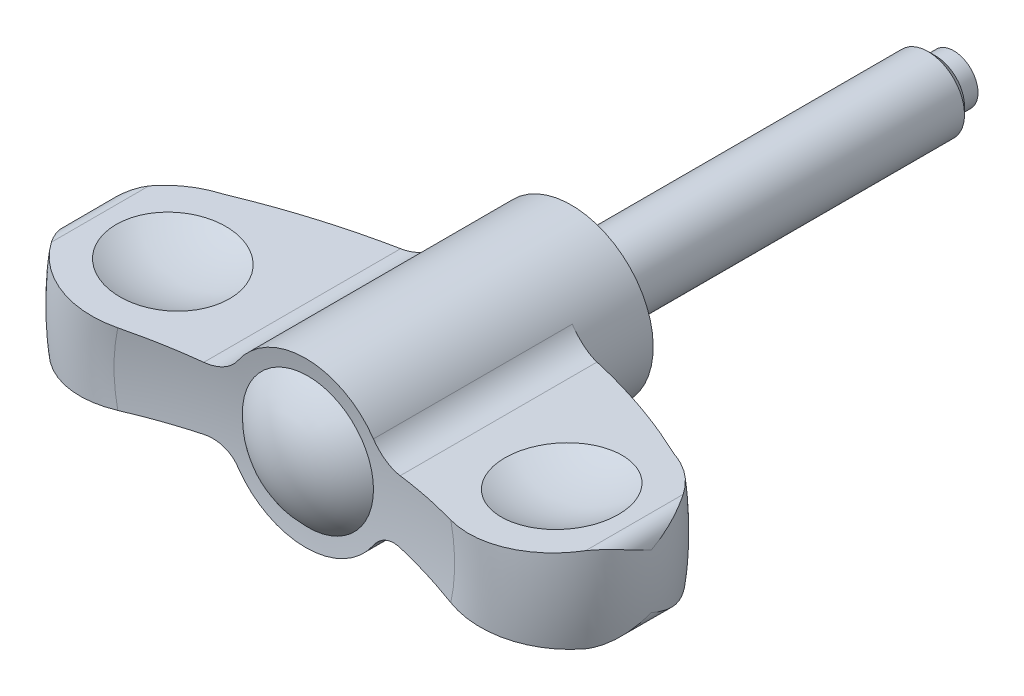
ISO-10303-21;
HEADER;
FILE_DESCRIPTION(('STEP AP214'),'2;1');
FILE_NAME('part.step','',(''),(''),'','','');
FILE_SCHEMA(('AUTOMOTIVE_DESIGN { 1 0 10303 214 1 1 1 1 }'));
ENDSEC;
DATA;
#1=APPLICATION_CONTEXT('core data for automotive mechanical design processes');
#2=APPLICATION_PROTOCOL_DEFINITION('international standard','automotive_design',2000,#1);
#3=PRODUCT_CONTEXT('',#1,'mechanical');
#4=PRODUCT('Part','Part','',(#3));
#5=PRODUCT_RELATED_PRODUCT_CATEGORY('part','',(#4));
#6=PRODUCT_DEFINITION_FORMATION('','',#4);
#7=PRODUCT_DEFINITION_CONTEXT('part definition',#1,'design');
#8=PRODUCT_DEFINITION('design','',#6,#7);
#9=PRODUCT_DEFINITION_SHAPE('','',#8);
#10=(LENGTH_UNIT() NAMED_UNIT(*) SI_UNIT(.MILLI.,.METRE.));
#11=(NAMED_UNIT(*) PLANE_ANGLE_UNIT() SI_UNIT($,.RADIAN.));
#12=(NAMED_UNIT(*) SI_UNIT($,.STERADIAN.) SOLID_ANGLE_UNIT());
#13=UNCERTAINTY_MEASURE_WITH_UNIT(LENGTH_MEASURE(1.E-05),#10,'distance_accuracy_value','');
#14=(GEOMETRIC_REPRESENTATION_CONTEXT(3) GLOBAL_UNCERTAINTY_ASSIGNED_CONTEXT((#13)) GLOBAL_UNIT_ASSIGNED_CONTEXT((#10,
#11,#12)) REPRESENTATION_CONTEXT('',''));
#15=CARTESIAN_POINT('',(0.,0.,0.));
#16=DIRECTION('',(0.,0.,1.));
#17=DIRECTION('',(1.,0.,0.));
#18=AXIS2_PLACEMENT_3D('',#15,#16,#17);
#19=CARTESIAN_POINT('',(0.,0.,60.8916836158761));
#20=DIRECTION('',(0.,0.,-1.));
#21=DIRECTION('',(0.,-1.,0.));
#22=AXIS2_PLACEMENT_3D('',#19,#20,#21);
#23=DEGENERATE_TOROIDAL_SURFACE('',#22,7.24809636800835,57.133049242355,.F.);
#24=CARTESIAN_POINT('',(-8.0882150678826,-2.57020553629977,5.96810530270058));
#25=CARTESIAN_POINT('',(-8.00997344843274,-2.56497338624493,5.94629000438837));
#26=CARTESIAN_POINT('',(-7.93143946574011,-2.5630200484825,5.92486614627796));
#27=CARTESIAN_POINT('',(-7.77422277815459,-2.56573749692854,5.88295181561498));
#28=CARTESIAN_POINT('',(-7.69554004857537,-2.57040950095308,5.86246151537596));
#29=CARTESIAN_POINT('',(-7.45993217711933,-2.59446790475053,5.80261995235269));
#30=CARTESIAN_POINT('',(-7.30348188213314,-2.62389903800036,5.76490768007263));
#31=CARTESIAN_POINT('',(-6.99637317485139,-2.70941155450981,5.69535012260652));
#32=CARTESIAN_POINT('',(-6.84572761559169,-2.7655487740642,5.66351732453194));
#33=CARTESIAN_POINT('',(-6.55526150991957,-2.90348395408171,5.60733410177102));
#34=CARTESIAN_POINT('',(-6.41542505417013,-2.98524327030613,5.5829725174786));
#35=CARTESIAN_POINT('',(-6.21564820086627,-3.12665619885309,5.55280138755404));
#36=CARTESIAN_POINT('',(-6.14994832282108,-3.17769981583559,5.54373343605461));
#37=CARTESIAN_POINT('',(-6.02316286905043,-3.28560819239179,5.52805647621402));
#38=CARTESIAN_POINT('',(-5.9620773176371,-3.34247298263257,5.52144748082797));
#39=CARTESIAN_POINT('',(-5.84481263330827,-3.46187538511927,5.51078652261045));
#40=CARTESIAN_POINT('',(-5.78866161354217,-3.52444182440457,5.5067484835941));
#41=CARTESIAN_POINT('',(-5.6821370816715,-3.65444758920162,5.50134928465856));
#42=CARTESIAN_POINT('',(-5.63176510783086,-3.721888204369,5.4999888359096));
#43=CARTESIAN_POINT('',(-5.58454817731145,-3.79148016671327,5.50000000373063));
#44=B_SPLINE_CURVE_WITH_KNOTS('',3,(#24,#25,#26,#27,#28,#29,#30,#31,#32,#33,#34,#35,#36,#37,#38,
#39,#40,#41,#42,#43),.UNSPECIFIED.,.F.,.F.,(4,2,2,2,2,2,2,2,2,4),(0.,0.244043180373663,
0.488131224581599,0.976413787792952,1.46572175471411,1.95429525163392,2.20506346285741,
2.45583299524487,2.70794934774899,2.96013265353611),.UNSPECIFIED.);
#45=CARTESIAN_POINT('',(-8.0880150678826,-2.5701921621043,5.96804953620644));
#46=VERTEX_POINT('',#45);
#47=CARTESIAN_POINT('',(-5.5846839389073,-3.791280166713,5.5));
#48=VERTEX_POINT('',#47);
#49=EDGE_CURVE('E156',#46,#48,#44,.T.);
#50=ORIENTED_EDGE('',*,*,#49,.F.);
#51=CARTESIAN_POINT('',(-18.5568278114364,-3.26987550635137,10.063986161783));
#52=CARTESIAN_POINT('',(-17.7202118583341,-3.21396025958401,9.63606709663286));
#53=CARTESIAN_POINT('',(-16.8730027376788,-3.15733701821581,9.2289826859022));
#54=CARTESIAN_POINT('',(-15.1615683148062,-3.04295325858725,8.45851890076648));
#55=CARTESIAN_POINT('',(-14.2973907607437,-2.98519593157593,8.09503297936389));
#56=CARTESIAN_POINT('',(-12.5519653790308,-2.86854038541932,7.41164455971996));
#57=CARTESIAN_POINT('',(-11.6707170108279,-2.80964213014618,7.09174344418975));
#58=CARTESIAN_POINT('',(-10.3366076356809,-2.72047689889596,6.64515483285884));
#59=CARTESIAN_POINT('',(-9.88928279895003,-2.6905799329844,6.50167304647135));
#60=CARTESIAN_POINT('',(-8.99112522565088,-2.63055155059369,6.22618011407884));
#61=CARTESIAN_POINT('',(-8.54029244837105,-2.60042013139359,6.09416910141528));
#62=CARTESIAN_POINT('',(-8.08781506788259,-2.57017879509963,5.96799377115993));
#63=B_SPLINE_CURVE_WITH_KNOTS('',3,(#51,#52,#53,#54,#55,#56,#57,#58,#59,#60,#61,#62),
.UNSPECIFIED.,.F.,.F.,(4,2,2,2,2,4),(0.,2.82377208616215,5.64049635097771,8.4573099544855,
9.86934742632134,11.281401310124),.UNSPECIFIED.);
#64=CARTESIAN_POINT('',(-18.55643678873,-3.26984937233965,10.063786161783));
#65=VERTEX_POINT('',#64);
#66=EDGE_CURVE('E201',#65,#46,#63,.T.);
#67=ORIENTED_EDGE('',*,*,#66,.F.);
#68=CARTESIAN_POINT('',(0.,0.,10.063786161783));
#69=DIRECTION('',(0.,0.,-1.));
#70=DIRECTION('',(0.,-1.,0.));
#71=AXIS2_PLACEMENT_3D('',#68,#69,#70);
#72=CIRCLE('',#71,18.84232632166);
#73=CARTESIAN_POINT('',(-18.55643678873,3.26984937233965,10.063786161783));
#74=VERTEX_POINT('',#73);
#75=EDGE_CURVE('E469',#65,#74,#72,.T.);
#76=ORIENTED_EDGE('',*,*,#75,.T.);
#77=CARTESIAN_POINT('',(-8.0878150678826,2.57017879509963,5.96799377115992));
#78=CARTESIAN_POINT('',(-8.43648524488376,2.59348217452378,6.06521586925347));
#79=CARTESIAN_POINT('',(-8.78418982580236,2.61672101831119,6.16591362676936));
#80=CARTESIAN_POINT('',(-9.47752423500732,2.66306003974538,6.37414417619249));
#81=CARTESIAN_POINT('',(-9.82315423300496,2.68616022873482,6.48167640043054));
#82=CARTESIAN_POINT('',(-10.8568675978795,2.7552484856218,6.81439605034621));
#83=CARTESIAN_POINT('',(-11.5417095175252,2.80101991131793,7.04968835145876));
#84=CARTESIAN_POINT('',(-13.5766416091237,2.93702464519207,7.79319141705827));
#85=CARTESIAN_POINT('',(-14.9128146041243,3.02632779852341,8.34061833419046));
#86=CARTESIAN_POINT('',(-16.618242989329,3.14031014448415,9.11672807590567));
#87=CARTESIAN_POINT('',(-17.0086949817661,3.1664060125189,9.29983650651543));
#88=CARTESIAN_POINT('',(-17.7857749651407,3.21834217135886,9.67514693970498));
#89=CARTESIAN_POINT('',(-18.1723980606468,3.2441821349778,9.86735912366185));
#90=CARTESIAN_POINT('',(-18.5568278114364,3.26987550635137,10.063986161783));
#91=B_SPLINE_CURVE_WITH_KNOTS('',3,(#77,#78,#79,#80,#81,#82,#83,#84,#85,#86,#87,#88,#89,#90),
.UNSPECIFIED.,.F.,.F.,(4,2,2,2,2,2,4),(0.,1.0881425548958,2.17619484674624,4.35250158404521,
8.68743833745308,9.98350841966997,11.2810638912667),.UNSPECIFIED.);
#92=CARTESIAN_POINT('',(-8.0880150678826,2.5701921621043,5.96804953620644));
#93=VERTEX_POINT('',#92);
#94=EDGE_CURVE('E262',#93,#74,#91,.T.);
#95=ORIENTED_EDGE('',*,*,#94,.F.);
#96=CARTESIAN_POINT('',(-5.58454817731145,3.79148016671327,5.50000000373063));
#97=CARTESIAN_POINT('',(-5.62703500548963,3.72886637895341,5.49999203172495));
#98=CARTESIAN_POINT('',(-5.67207292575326,3.66799067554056,5.50109190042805));
#99=CARTESIAN_POINT('',(-5.7668723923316,3.55013742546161,5.50546469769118));
#100=CARTESIAN_POINT('',(-5.81663303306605,3.49315913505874,5.50873721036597));
#101=CARTESIAN_POINT('',(-5.92037232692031,3.38365000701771,5.51740071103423));
#102=CARTESIAN_POINT('',(-5.97433893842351,3.33110730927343,5.52278581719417));
#103=CARTESIAN_POINT('',(-6.0861731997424,3.23065312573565,5.53558959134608));
#104=CARTESIAN_POINT('',(-6.14404090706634,3.1827417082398,5.54300828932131));
#105=CARTESIAN_POINT('',(-6.32281948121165,3.04645743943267,5.56816484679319));
#106=CARTESIAN_POINT('',(-6.44903201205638,2.96540189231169,5.58881397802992));
#107=CARTESIAN_POINT('',(-6.71175482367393,2.82481579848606,5.63683026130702));
#108=CARTESIAN_POINT('',(-6.84827321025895,2.76530241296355,5.66420274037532));
#109=CARTESIAN_POINT('',(-7.13180529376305,2.66747892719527,5.72532830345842));
#110=CARTESIAN_POINT('',(-7.27900617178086,2.62981214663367,5.75923917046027));
#111=CARTESIAN_POINT('',(-7.576319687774,2.57880440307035,5.83159976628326));
#112=CARTESIAN_POINT('',(-7.72642802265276,2.56542990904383,5.87004316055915));
#113=CARTESIAN_POINT('',(-7.91146899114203,2.56375196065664,5.91959867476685));
#114=CARTESIAN_POINT('',(-7.94691227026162,2.56410633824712,5.92918950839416));
#115=CARTESIAN_POINT('',(-8.01766035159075,2.56615563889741,5.94852854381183));
#116=CARTESIAN_POINT('',(-8.05296528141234,2.56784856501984,5.95827649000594));
#117=CARTESIAN_POINT('',(-8.0882150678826,2.57020553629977,5.96810530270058));
#118=B_SPLINE_CURVE_WITH_KNOTS('',3,(#96,#97,#98,#99,#100,#101,#102,#103,#104,#105,#106,#107,
#108,#109,#110,#111,#112,#113,#114,#115,#116,#117),.UNSPECIFIED.,.F.,.F.,(4,2,2,2,2,2,2,2,2,2,
4),(0.,0.226923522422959,0.453803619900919,0.680056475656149,0.906312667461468,1.35828167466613,
1.81060994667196,2.27565813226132,2.74006391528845,2.85020967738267,2.96019142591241),.UNSPECIFIED.);
#119=CARTESIAN_POINT('',(-5.5846839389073,3.791280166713,5.5));
#120=VERTEX_POINT('',#119);
#121=EDGE_CURVE('E254',#120,#93,#118,.T.);
#122=ORIENTED_EDGE('',*,*,#121,.F.);
#123=CARTESIAN_POINT('',(0.,0.,5.5));
#124=DIRECTION('',(0.,0.,-1.));
#125=DIRECTION('',(0.,-1.,0.));
#126=AXIS2_PLACEMENT_3D('',#123,#124,#125);
#127=CIRCLE('',#126,6.75);
#128=EDGE_CURVE('E462',#48,#120,#127,.T.);
#129=ORIENTED_EDGE('',*,*,#128,.F.);
#130=EDGE_LOOP('',(#50,#67,#76,#95,#122,#129));
#131=FACE_BOUND('',#130,.T.);
#132=ADVANCED_FACE('F14',(#131),#23,.F.);
#133=CARTESIAN_POINT('',(0.,0.,16.8000000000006));
#134=DIRECTION('',(0.,0.,-1.));
#135=DIRECTION('',(0.,-1.,0.));
#136=AXIS2_PLACEMENT_3D('',#133,#134,#135);
#137=TOROIDAL_SURFACE('',#136,16.3000000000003,7.19999999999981);
#138=CARTESIAN_POINT('',(-13.443007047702,-2.92809317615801,10.063586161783));
#139=CARTESIAN_POINT('',(-13.2500457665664,-2.9151966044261,10.1357408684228));
#140=CARTESIAN_POINT('',(-13.0601324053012,-2.90250374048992,10.2160710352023));
#141=CARTESIAN_POINT('',(-12.6877100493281,-2.87761288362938,10.3924240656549));
#142=CARTESIAN_POINT('',(-12.5052008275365,-2.86541487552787,10.4884464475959));
#143=CARTESIAN_POINT('',(-12.1489194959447,-2.84160280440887,10.6955091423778));
#144=CARTESIAN_POINT('',(-11.975145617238,-2.82998862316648,10.8065463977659));
#145=CARTESIAN_POINT('',(-11.637533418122,-2.80742430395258,11.0428740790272));
#146=CARTESIAN_POINT('',(-11.4736949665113,-2.79647415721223,11.168164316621));
#147=CARTESIAN_POINT('',(-11.1570734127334,-2.7753127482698,11.4321870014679));
#148=CARTESIAN_POINT('',(-11.0042945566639,-2.76510176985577,11.5709245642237));
#149=CARTESIAN_POINT('',(-10.7109328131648,-2.74549493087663,11.8608983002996));
#150=CARTESIAN_POINT('',(-10.5703542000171,-2.73609935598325,12.0121388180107));
#151=CARTESIAN_POINT('',(-10.3025713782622,-2.71820208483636,12.3259661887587));
#152=CARTESIAN_POINT('',(-10.1753613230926,-2.70969999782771,12.4885480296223));
#153=CARTESIAN_POINT('',(-9.93523518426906,-2.69365116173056,12.823988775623));
#154=CARTESIAN_POINT('',(-9.82231883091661,-2.68610439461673,12.996847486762));
#155=CARTESIAN_POINT('',(-9.6124094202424,-2.67207509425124,13.3504168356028));
#156=CARTESIAN_POINT('',(-9.515312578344,-2.66558562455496,13.5310655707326));
#157=CARTESIAN_POINT('',(-9.33694719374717,-2.65366456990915,13.8999735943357));
#158=CARTESIAN_POINT('',(-9.25567307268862,-2.64823261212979,14.088230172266));
#159=CARTESIAN_POINT('',(-9.1095973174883,-2.63846963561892,14.4711021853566));
#160=CARTESIAN_POINT('',(-9.0447989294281,-2.63413883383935,14.6657188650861));
#161=CARTESIAN_POINT('',(-8.93227844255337,-2.62661852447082,15.0598492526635));
#162=CARTESIAN_POINT('',(-8.88455601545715,-2.62342899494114,15.25936286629));
#163=CARTESIAN_POINT('',(-8.80746852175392,-2.61827685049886,15.6574650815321));
#164=CARTESIAN_POINT('',(-8.77773054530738,-2.61628931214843,15.8559812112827));
#165=CARTESIAN_POINT('',(-8.73529826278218,-2.61345334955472,16.2548338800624));
#166=CARTESIAN_POINT('',(-8.72260367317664,-2.61260490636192,16.4551703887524));
#167=CARTESIAN_POINT('',(-8.71437606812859,-2.61205501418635,16.8561671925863));
#168=CARTESIAN_POINT('',(-8.71884052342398,-2.6123533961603,17.0568274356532));
#169=CARTESIAN_POINT('',(-8.74488386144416,-2.6140940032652,17.4570282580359));
#170=CARTESIAN_POINT('',(-8.76646264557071,-2.61553622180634,17.6565688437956));
#171=CARTESIAN_POINT('',(-8.82608238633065,-2.61952090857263,18.0500864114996));
#172=CARTESIAN_POINT('',(-8.8638706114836,-2.62204648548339,18.244101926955));
#173=CARTESIAN_POINT('',(-8.95554073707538,-2.62817326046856,18.6283441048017));
#174=CARTESIAN_POINT('',(-9.00942811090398,-2.6317748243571,18.818569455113));
#175=CARTESIAN_POINT('',(-9.13281555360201,-2.64002142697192,19.1937999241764));
#176=CARTESIAN_POINT('',(-9.20231107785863,-2.64466616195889,19.3788065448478));
#177=CARTESIAN_POINT('',(-9.35638258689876,-2.65496353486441,19.7424794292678));
#178=CARTESIAN_POINT('',(-9.4409642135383,-2.66061654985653,19.921143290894));
#179=CARTESIAN_POINT('',(-9.62545322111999,-2.67294687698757,20.2726485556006));
#180=CARTESIAN_POINT('',(-9.7255069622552,-2.6796339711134,20.4454127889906));
#181=CARTESIAN_POINT('',(-9.93957002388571,-2.69394088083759,20.7821124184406));
#182=CARTESIAN_POINT('',(-10.0535844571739,-2.70156103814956,20.9460445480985));
#183=CARTESIAN_POINT('',(-10.2946584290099,-2.71767322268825,21.2638986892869));
#184=CARTESIAN_POINT('',(-10.4217143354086,-2.7261650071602,21.4178234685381));
#185=CARTESIAN_POINT('',(-10.688029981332,-2.74396421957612,21.714770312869));
#186=CARTESIAN_POINT('',(-10.8272940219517,-2.75327193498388,21.8577885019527));
#187=CARTESIAN_POINT('',(-11.1201972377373,-2.77284812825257,22.1349543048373));
#188=CARTESIAN_POINT('',(-11.2740848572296,-2.78313321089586,22.2688382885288));
#189=CARTESIAN_POINT('',(-11.5924511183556,-2.80441122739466,22.5232972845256));
#190=CARTESIAN_POINT('',(-11.7569299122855,-2.81540417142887,22.6438721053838));
#191=CARTESIAN_POINT('',(-12.0953583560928,-2.83802304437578,22.8709220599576));
#192=CARTESIAN_POINT('',(-12.2693100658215,-2.84964911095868,22.9773941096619));
#193=CARTESIAN_POINT('',(-12.6253835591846,-2.87344729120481,23.1754492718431));
#194=CARTESIAN_POINT('',(-12.8075027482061,-2.88561923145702,23.267037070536));
#195=CARTESIAN_POINT('',(-13.1810420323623,-2.91058473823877,23.4357878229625));
#196=CARTESIAN_POINT('',(-13.3725503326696,-2.92338419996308,23.5127547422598));
#197=CARTESIAN_POINT('',(-13.7613485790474,-2.94936953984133,23.6502587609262));
#198=CARTESIAN_POINT('',(-13.958638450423,-2.96255541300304,23.7107960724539));
#199=CARTESIAN_POINT('',(-14.3576152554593,-2.98922103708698,23.8149976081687));
#200=CARTESIAN_POINT('',(-14.5593023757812,-3.00270080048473,23.8586611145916));
#201=CARTESIAN_POINT('',(-14.9656299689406,-3.02985771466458,23.9287762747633));
#202=CARTESIAN_POINT('',(-15.1702703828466,-3.04353486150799,23.9552282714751));
#203=CARTESIAN_POINT('',(-15.5810553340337,-3.07098968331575,23.9907056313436));
#204=CARTESIAN_POINT('',(-15.7871999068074,-3.08476736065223,23.9997305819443));
#205=CARTESIAN_POINT('',(-16.1994347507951,-3.11231908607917,24.0002574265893));
#206=CARTESIAN_POINT('',(-16.4055250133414,-3.12609313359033,23.9917658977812));
#207=CARTESIAN_POINT('',(-16.8162992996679,-3.15354724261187,23.9572980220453));
#208=CARTESIAN_POINT('',(-17.020982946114,-3.16722727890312,23.9313171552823));
#209=CARTESIAN_POINT('',(-17.4273317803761,-3.19438561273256,23.8620348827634));
#210=CARTESIAN_POINT('',(-17.6289980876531,-3.20786398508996,23.8187400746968));
#211=CARTESIAN_POINT('',(-18.0267250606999,-3.23444607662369,23.7154246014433));
#212=CARTESIAN_POINT('',(-18.2228121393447,-3.24755156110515,23.6555060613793));
#213=CARTESIAN_POINT('',(-18.6091495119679,-3.27337242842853,23.5192613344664));
#214=CARTESIAN_POINT('',(-18.7994018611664,-3.28608794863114,23.4429410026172));
#215=CARTESIAN_POINT('',(-19.1728922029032,-3.31105018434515,23.2743446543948));
#216=CARTESIAN_POINT('',(-19.3561252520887,-3.32329656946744,23.182057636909));
#217=CARTESIAN_POINT('',(-19.7140940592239,-3.34722142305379,22.9822113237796));
#218=CARTESIAN_POINT('',(-19.8888301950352,-3.35889991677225,22.8746527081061));
#219=CARTESIAN_POINT('',(-20.2275235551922,-3.38153649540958,22.6457025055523));
#220=CARTESIAN_POINT('',(-20.3915386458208,-3.39249844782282,22.5243968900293));
#221=CARTESIAN_POINT('',(-20.7087215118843,-3.41369737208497,22.268296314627));
#222=CARTESIAN_POINT('',(-20.8618896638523,-3.42393436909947,22.1335018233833));
#223=CARTESIAN_POINT('',(-21.1559703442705,-3.44358925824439,21.8516648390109));
#224=CARTESIAN_POINT('',(-21.2969064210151,-3.45300872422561,21.7046469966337));
#225=CARTESIAN_POINT('',(-21.5657772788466,-3.47097871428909,21.3992346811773));
#226=CARTESIAN_POINT('',(-21.6937203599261,-3.47952979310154,21.2408475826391));
#227=CARTESIAN_POINT('',(-21.8466005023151,-3.48974754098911,21.034256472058));
#228=CARTESIAN_POINT('',(-21.8780226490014,-3.49184764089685,20.9907857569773));
#229=CARTESIAN_POINT('',(-21.9398601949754,-3.49598055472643,20.903190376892));
#230=CARTESIAN_POINT('',(-21.9702764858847,-3.49801342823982,20.8590663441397));
#231=CARTESIAN_POINT('',(-22.0002,-3.50001336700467,20.8146029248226));
#232=B_SPLINE_CURVE_WITH_KNOTS('',3,(#138,#139,#140,#141,#142,#143,#144,#145,#146,#147,#148,
#149,#150,#151,#152,#153,#154,#155,#156,#157,#158,#159,#160,#161,#162,#163,#164,#165,#166,#167,
#168,#169,#170,#171,#172,#173,#174,#175,#176,#177,#178,#179,#180,#181,#182,#183,#184,#185,#186,
#187,#188,#189,#190,#191,#192,#193,#194,#195,#196,#197,#198,#199,#200,#201,#202,#203,#204,#205,
#206,#207,#208,#209,#210,#211,#212,#213,#214,#215,#216,#217,#218,#219,#220,#221,#222,#223,#224,
#225,#226,#227,#228,#229,#230,#231),.UNSPECIFIED.,.F.,.F.,(4,2,2,2,2,2,2,2,2,2,2,2,2,2,2,2,2,2,
2,2,2,2,2,2,2,2,2,2,2,2,2,2,2,2,2,2,2,2,2,2,2,2,2,2,2,2,4),(0.,0.61905342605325,
1.23808785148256,1.85699641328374,2.47589680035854,3.09503355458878,3.71438635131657,
4.3334671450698,4.95253625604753,5.56736438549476,6.18197536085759,6.79670733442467,
7.41142748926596,8.01292036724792,8.61440323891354,9.21579745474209,9.81718820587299,
10.4095249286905,11.0020632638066,11.5944292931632,12.1870173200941,12.7855991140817,
13.3844007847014,13.9830361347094,14.5818832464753,15.1938756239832,15.8058768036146,
16.4180115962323,17.0299532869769,17.6495959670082,18.2692306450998,18.8888916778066,
19.5085403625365,20.1282037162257,20.7476344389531,21.3672253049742,21.9865802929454,
22.6022115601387,23.217623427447,23.8334610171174,24.4492711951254,25.061423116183,
25.6735537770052,26.2844785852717,26.8950106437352,27.0560402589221,27.2169230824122),.UNSPECIFIED.);
#233=CARTESIAN_POINT('',(-13.7144513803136,-2.94623516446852,23.631914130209));
#234=VERTEX_POINT('',#233);
#235=CARTESIAN_POINT('',(-22.,-3.5,20.8149000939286));
#236=VERTEX_POINT('',#235);
#237=EDGE_CURVE('E270',#234,#236,#232,.T.);
#238=ORIENTED_EDGE('',*,*,#237,.F.);
#239=CARTESIAN_POINT('',(0.,0.,23.631914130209));
#240=DIRECTION('',(0.,0.,-1.));
#241=DIRECTION('',(0.,-1.,0.));
#242=AXIS2_PLACEMENT_3D('',#239,#240,#241);
#243=CIRCLE('',#242,14.027347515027);
#244=CARTESIAN_POINT('',(-13.7144513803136,2.94623516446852,23.631914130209));
#245=VERTEX_POINT('',#244);
#246=EDGE_CURVE('E207',#234,#245,#243,.T.);
#247=ORIENTED_EDGE('',*,*,#246,.T.);
#248=CARTESIAN_POINT('',(-22.0002,3.50001336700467,20.8146029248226));
#249=CARTESIAN_POINT('',(-21.8869659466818,3.49244536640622,20.9829001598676));
#250=CARTESIAN_POINT('',(-21.7665908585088,3.48440009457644,21.146364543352));
#251=CARTESIAN_POINT('',(-21.5125154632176,3.46741895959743,21.4625195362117));
#252=CARTESIAN_POINT('',(-21.3788160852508,3.45848315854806,21.6152108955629));
#253=CARTESIAN_POINT('',(-21.0991608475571,3.43979239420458,21.9086013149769));
#254=CARTESIAN_POINT('',(-20.9532163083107,3.43003818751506,22.0493112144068));
#255=CARTESIAN_POINT('',(-20.6500231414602,3.40977426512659,22.3179109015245));
#256=CARTESIAN_POINT('',(-20.492774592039,3.399264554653,22.4458007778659));
#257=CARTESIAN_POINT('',(-20.1680719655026,3.377563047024,22.6878898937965));
#258=CARTESIAN_POINT('',(-20.0006161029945,3.36637113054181,22.8020867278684));
#259=CARTESIAN_POINT('',(-19.6566594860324,3.34338278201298,23.0160136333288));
#260=CARTESIAN_POINT('',(-19.4801554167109,3.33158612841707,23.115738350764));
#261=CARTESIAN_POINT('',(-19.1195107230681,3.30748243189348,23.2999405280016));
#262=CARTESIAN_POINT('',(-18.9353740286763,3.29517565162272,23.384425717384));
#263=CARTESIAN_POINT('',(-18.5606181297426,3.27012883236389,23.5376689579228));
#264=CARTESIAN_POINT('',(-18.3699965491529,3.25738863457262,23.6064211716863));
#265=CARTESIAN_POINT('',(-17.9830362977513,3.23152613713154,23.7279050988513));
#266=CARTESIAN_POINT('',(-17.7866806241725,3.2184027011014,23.7805824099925));
#267=CARTESIAN_POINT('',(-17.3901835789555,3.19190281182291,23.869278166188));
#268=CARTESIAN_POINT('',(-17.1900408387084,3.17852626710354,23.905290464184));
#269=CARTESIAN_POINT('',(-16.7874574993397,3.15161960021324,23.9604036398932));
#270=CARTESIAN_POINT('',(-16.5850169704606,3.13808948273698,23.9795050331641));
#271=CARTESIAN_POINT('',(-16.1792478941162,3.11096989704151,24.0006952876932));
#272=CARTESIAN_POINT('',(-15.9759193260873,3.09738042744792,24.0027837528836));
#273=CARTESIAN_POINT('',(-15.5684666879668,3.07014832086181,23.9899203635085));
#274=CARTESIAN_POINT('',(-15.364346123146,3.05650591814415,23.9748568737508));
#275=CARTESIAN_POINT('',(-14.9580777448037,3.02935296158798,23.927642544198));
#276=CARTESIAN_POINT('',(-14.755929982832,3.01584241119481,23.8954912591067));
#277=CARTESIAN_POINT('',(-14.3550670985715,2.98905073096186,23.8143605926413));
#278=CARTESIAN_POINT('',(-14.1563513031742,2.97576955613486,23.7653845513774));
#279=CARTESIAN_POINT('',(-13.7636331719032,2.94952223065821,23.6509482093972));
#280=CARTESIAN_POINT('',(-13.5696323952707,2.93655618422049,23.5854825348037));
#281=CARTESIAN_POINT('',(-13.1865164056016,2.91095061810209,23.4380671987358));
#282=CARTESIAN_POINT('',(-12.9974412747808,2.89831377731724,23.3560128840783));
#283=CARTESIAN_POINT('',(-12.6268363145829,2.87354438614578,23.1762764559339));
#284=CARTESIAN_POINT('',(-12.4453065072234,2.86141183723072,23.0785942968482));
#285=CARTESIAN_POINT('',(-12.0910342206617,2.83773404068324,22.8682633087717));
#286=CARTESIAN_POINT('',(-11.918293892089,2.8261889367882,22.7556108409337));
#287=CARTESIAN_POINT('',(-11.5829402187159,2.80377556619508,22.5161828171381));
#288=CARTESIAN_POINT('',(-11.420323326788,2.79290706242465,22.3894122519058));
#289=CARTESIAN_POINT('',(-11.1059013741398,2.77189266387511,22.1222291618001));
#290=CARTESIAN_POINT('',(-10.954126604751,2.76174879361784,21.9817808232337));
#291=CARTESIAN_POINT('',(-10.663050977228,2.74229474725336,21.6885550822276));
#292=CARTESIAN_POINT('',(-10.5237454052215,2.7329842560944,21.5357823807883));
#293=CARTESIAN_POINT('',(-10.2585504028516,2.71525994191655,21.2188580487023));
#294=CARTESIAN_POINT('',(-10.1326659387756,2.7068464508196,21.0547022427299));
#295=CARTESIAN_POINT('',(-9.89540453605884,2.69098907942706,20.716270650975));
#296=CARTESIAN_POINT('',(-9.78402188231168,2.68354481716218,20.5419988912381));
#297=CARTESIAN_POINT('',(-9.57753567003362,2.66974430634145,20.1860989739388));
#298=CARTESIAN_POINT('',(-9.48229586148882,2.66337895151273,20.0045502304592));
#299=CARTESIAN_POINT('',(-9.3077215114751,2.65171127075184,19.6340070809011));
#300=CARTESIAN_POINT('',(-9.22838099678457,2.64640854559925,19.4450155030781));
#301=CARTESIAN_POINT('',(-9.08624438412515,2.63690884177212,19.0608700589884));
#302=CARTESIAN_POINT('',(-9.02344908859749,2.63271191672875,18.865715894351));
#303=CARTESIAN_POINT('',(-8.91497467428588,2.62546202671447,18.4706862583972));
#304=CARTESIAN_POINT('',(-8.86929523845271,2.62240904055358,18.2708108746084));
#305=CARTESIAN_POINT('',(-8.79627719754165,2.61752887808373,17.8722020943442));
#306=CARTESIAN_POINT('',(-8.76856256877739,2.61567657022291,17.6735378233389));
#307=CARTESIAN_POINT('',(-8.73017446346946,2.61311090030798,17.2745631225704));
#308=CARTESIAN_POINT('',(-8.71950071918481,2.61239752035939,17.0742527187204));
#309=CARTESIAN_POINT('',(-8.71529310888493,2.61211630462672,16.6734663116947));
#310=CARTESIAN_POINT('',(-8.72175798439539,2.61254838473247,16.4729903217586));
#311=CARTESIAN_POINT('',(-8.75176494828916,2.61455390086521,16.0733272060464));
#312=CARTESIAN_POINT('',(-8.77530694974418,2.61612733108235,15.8741400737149));
#313=CARTESIAN_POINT('',(-8.83878915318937,2.62037016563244,15.4813635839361));
#314=CARTESIAN_POINT('',(-8.87848770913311,2.62302341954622,15.287734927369));
#315=CARTESIAN_POINT('',(-8.97393104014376,2.62940237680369,14.9044232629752));
#316=CARTESIAN_POINT('',(-9.02968125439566,2.63312844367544,14.7147416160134));
#317=CARTESIAN_POINT('',(-9.15673580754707,2.64162013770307,14.3407362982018));
#318=CARTESIAN_POINT('',(-9.22803659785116,2.64638552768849,14.1564114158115));
#319=CARTESIAN_POINT('',(-9.38562068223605,2.65691766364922,13.7943056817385));
#320=CARTESIAN_POINT('',(-9.47190458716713,2.66268445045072,13.6165250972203));
#321=CARTESIAN_POINT('',(-9.65980249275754,2.67524261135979,13.2667770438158));
#322=CARTESIAN_POINT('',(-9.7615742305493,2.6820445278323,13.0948947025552));
#323=CARTESIAN_POINT('',(-9.97895442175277,2.69657313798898,12.7601587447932));
#324=CARTESIAN_POINT('',(-10.0945629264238,2.70429983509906,12.5973051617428));
#325=CARTESIAN_POINT('',(-10.3388280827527,2.72062530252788,12.2815998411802));
#326=CARTESIAN_POINT('',(-10.4674919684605,2.7292245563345,12.1287537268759));
#327=CARTESIAN_POINT('',(-10.7368892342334,2.74722972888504,11.8341521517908));
#328=CARTESIAN_POINT('',(-10.8776225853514,2.75663564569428,11.6923966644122));
#329=CARTESIAN_POINT('',(-11.1735584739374,2.77641452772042,11.4177499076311));
#330=CARTESIAN_POINT('',(-11.3290201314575,2.78680481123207,11.2851390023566));
#331=CARTESIAN_POINT('',(-11.6503816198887,2.80828301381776,11.0334204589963));
#332=CARTESIAN_POINT('',(-11.8162777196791,2.81937068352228,10.9143080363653));
#333=CARTESIAN_POINT('',(-12.1571151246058,2.84215055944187,10.6905168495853));
#334=CARTESIAN_POINT('',(-12.3320419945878,2.85384180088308,10.5858159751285));
#335=CARTESIAN_POINT('',(-12.6898958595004,2.8777589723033,10.391386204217));
#336=CARTESIAN_POINT('',(-12.8728180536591,2.88998458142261,10.3016484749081));
#337=CARTESIAN_POINT('',(-13.122358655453,2.90666263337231,10.1918600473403));
#338=CARTESIAN_POINT('',(-13.1860214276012,2.91091753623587,10.1649193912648));
#339=CARTESIAN_POINT('',(-13.3140099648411,2.91947165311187,10.112878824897));
#340=CARTESIAN_POINT('',(-13.3783349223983,2.92377081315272,10.0877769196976));
#341=CARTESIAN_POINT('',(-13.443007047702,2.92809317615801,10.063586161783));
#342=B_SPLINE_CURVE_WITH_KNOTS('',3,(#248,#249,#250,#251,#252,#253,#254,#255,#256,#257,#258,
#259,#260,#261,#262,#263,#264,#265,#266,#267,#268,#269,#270,#271,#272,#273,#274,#275,#276,#277,
#278,#279,#280,#281,#282,#283,#284,#285,#286,#287,#288,#289,#290,#291,#292,#293,#294,#295,#296,
#297,#298,#299,#300,#301,#302,#303,#304,#305,#306,#307,#308,#309,#310,#311,#312,#313,#314,#315,
#316,#317,#318,#319,#320,#321,#322,#323,#324,#325,#326,#327,#328,#329,#330,#331,#332,#333,#334,
#335,#336,#337,#338,#339,#340,#341),.UNSPECIFIED.,.F.,.F.,(4,2,2,2,2,2,2,2,2,2,2,2,2,2,2,2,2,2,
2,2,2,2,2,2,2,2,2,2,2,2,2,2,2,2,2,2,2,2,2,2,2,2,2,2,2,2,4),(0.,0.608767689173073,
1.21749295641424,1.82566153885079,2.43382591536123,3.04209697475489,3.65059249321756,
4.25877850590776,4.86718980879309,5.47763788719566,6.0883109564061,6.69896540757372,
7.30963407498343,7.92430017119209,8.53898228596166,9.15354244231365,9.76830314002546,
10.3870705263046,11.0058397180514,11.6247595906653,12.2434613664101,12.8638290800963,
13.4839612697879,14.1043221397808,14.7244377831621,15.3390262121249,15.9533833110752,
16.5677702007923,17.1821457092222,17.7832066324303,18.3842581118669,18.9852654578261,
19.5862697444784,20.1785973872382,20.77112597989,21.3635195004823,21.9559371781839,
22.5548514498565,23.1537679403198,23.7530181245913,24.3522668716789,24.9653566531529,
25.5782284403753,26.1901492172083,26.8017074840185,27.0094652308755,27.2169941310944),.UNSPECIFIED.);
#343=CARTESIAN_POINT('',(-22.,3.5,20.8149000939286));
#344=VERTEX_POINT('',#343);
#345=EDGE_CURVE('E292',#344,#245,#342,.T.);
#346=ORIENTED_EDGE('',*,*,#345,.F.);
#347=CARTESIAN_POINT('',(-23.3936651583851,2.23303167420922,16.8000000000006));
#348=CARTESIAN_POINT('',(-23.3934426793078,2.23536251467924,16.8051493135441));
#349=CARTESIAN_POINT('',(-23.3932143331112,2.23769289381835,16.8102988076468));
#350=CARTESIAN_POINT('',(-23.374314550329,2.42570445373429,17.2258528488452));
#351=CARTESIAN_POINT('',(-23.3183956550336,2.60830531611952,17.6373544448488));
#352=CARTESIAN_POINT('',(-23.1798743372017,2.85965877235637,18.2505518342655));
#353=CARTESIAN_POINT('',(-23.1245479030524,2.93972311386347,18.4543861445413));
#354=CARTESIAN_POINT('',(-22.9956909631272,3.0890981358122,18.8603432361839));
#355=CARTESIAN_POINT('',(-22.922168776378,3.15841370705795,19.0624667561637));
#356=CARTESIAN_POINT('',(-22.7850793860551,3.2611636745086,19.3959296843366));
#357=CARTESIAN_POINT('',(-22.7265638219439,3.29880232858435,19.5280746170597));
#358=CARTESIAN_POINT('',(-22.6018254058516,3.36602668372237,19.7906656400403));
#359=CARTESIAN_POINT('',(-22.5356088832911,3.39561893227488,19.9211130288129));
#360=CARTESIAN_POINT('',(-22.3953169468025,3.44509635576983,20.1805136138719));
#361=CARTESIAN_POINT('',(-22.3212053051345,3.46493421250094,20.3094566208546));
#362=CARTESIAN_POINT('',(-22.2046559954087,3.4855237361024,20.5007658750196));
#363=CARTESIAN_POINT('',(-22.1648550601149,3.49085996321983,20.5642643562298));
#364=CARTESIAN_POINT('',(-22.083565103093,3.49809816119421,20.6904076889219));
#365=CARTESIAN_POINT('',(-22.0420753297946,3.49999858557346,20.7530521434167));
#366=CARTESIAN_POINT('',(-21.9998,3.49999998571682,20.8151941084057));
#367=B_SPLINE_CURVE_WITH_KNOTS('',3,(#347,#348,#349,#350,#351,#352,#353,#354,#355,#356,#357,
#358,#359,#360,#361,#362,#363,#364,#365,#366),.UNSPECIFIED.,.F.,.F.,(4,2,2,2,2,2,2,2,2,4),(0.,
0.0169705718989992,1.36944581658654,2.04642868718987,2.72310261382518,3.17077232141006,
3.61807665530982,4.06752995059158,4.29283181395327,4.51823506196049),.UNSPECIFIED.);
#368=CARTESIAN_POINT('',(-23.393665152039,2.2330317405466,16.8000000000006));
#369=VERTEX_POINT('',#368);
#370=EDGE_CURVE('E495',#369,#344,#367,.T.);
#371=ORIENTED_EDGE('',*,*,#370,.F.);
#372=CARTESIAN_POINT('',(-21.9998,3.49999998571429,12.7848058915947));
#373=CARTESIAN_POINT('',(-22.0666741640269,3.49996244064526,12.883087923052));
#374=CARTESIAN_POINT('',(-22.1315514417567,3.49523252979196,12.9826100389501));
#375=CARTESIAN_POINT('',(-22.2568815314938,3.47769367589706,13.1835115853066));
#376=CARTESIAN_POINT('',(-22.3173409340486,3.46489705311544,13.2848879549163));
#377=CARTESIAN_POINT('',(-22.433364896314,3.432590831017,13.488746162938));
#378=CARTESIAN_POINT('',(-22.4889490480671,3.41310980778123,13.5912215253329));
#379=CARTESIAN_POINT('',(-22.595372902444,3.36841027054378,13.7974289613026));
#380=CARTESIAN_POINT('',(-22.6462099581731,3.34318858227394,13.9011616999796));
#381=CARTESIAN_POINT('',(-22.7740899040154,3.27011468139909,14.1765334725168));
#382=CARTESIAN_POINT('',(-22.8470051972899,3.21812877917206,14.3490158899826));
#383=CARTESIAN_POINT('',(-22.9794561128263,3.10414337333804,14.6957451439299));
#384=CARTESIAN_POINT('',(-23.0389856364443,3.04213932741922,14.8699927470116));
#385=CARTESIAN_POINT('',(-23.197520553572,2.84462859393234,15.395179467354));
#386=CARTESIAN_POINT('',(-23.27632830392,2.69771476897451,15.7482515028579));
#387=CARTESIAN_POINT('',(-23.3443046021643,2.49442989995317,16.2153989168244));
#388=CARTESIAN_POINT('',(-23.3580236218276,2.44419371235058,16.329236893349));
#389=CARTESIAN_POINT('',(-23.3797700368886,2.34273549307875,16.5569077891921));
#390=CARTESIAN_POINT('',(-23.3878040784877,2.29151468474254,16.6707405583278));
#391=CARTESIAN_POINT('',(-23.3932143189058,2.2376929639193,16.7897010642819));
#392=CARTESIAN_POINT('',(-23.3934426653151,2.23536258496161,16.7948505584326));
#393=CARTESIAN_POINT('',(-23.3936651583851,2.23303167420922,16.8000000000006));
#394=B_SPLINE_CURVE_WITH_KNOTS('',3,(#372,#373,#374,#375,#376,#377,#378,#379,#380,#381,#382,
#383,#384,#385,#386,#387,#388,#389,#390,#391,#392,#393),.UNSPECIFIED.,.F.,.F.,(4,2,2,2,2,2,2,2,
2,2,4),(0.,0.356372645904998,0.712202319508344,1.06652937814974,1.4210528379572,
2.00316709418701,2.58554603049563,3.75135617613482,4.12686584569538,4.50193578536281,
4.51890635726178),.UNSPECIFIED.);
#395=CARTESIAN_POINT('',(-22.,3.5,12.7850999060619));
#396=VERTEX_POINT('',#395);
#397=EDGE_CURVE('E493',#396,#369,#394,.T.);
#398=ORIENTED_EDGE('',*,*,#397,.F.);
#399=CARTESIAN_POINT('',(-18.5559048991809,3.26981382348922,10.063586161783));
#400=CARTESIAN_POINT('',(-18.7481532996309,3.28266274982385,10.1358408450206));
#401=CARTESIAN_POINT('',(-18.937321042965,3.29530578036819,10.2163336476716));
#402=CARTESIAN_POINT('',(-19.3081618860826,3.32009093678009,10.3931469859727));
#403=CARTESIAN_POINT('',(-19.4898343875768,3.33223302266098,10.4894687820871));
#404=CARTESIAN_POINT('',(-19.8398224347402,3.3556244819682,10.6946430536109));
#405=CARTESIAN_POINT('',(-20.0083599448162,3.36688869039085,10.8031155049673));
#406=CARTESIAN_POINT('',(-20.3358278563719,3.38877501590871,11.0337190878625));
#407=CARTESIAN_POINT('',(-20.4947599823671,3.39939724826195,11.1558477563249));
#408=CARTESIAN_POINT('',(-20.776421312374,3.41822208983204,11.3915935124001));
#409=CARTESIAN_POINT('',(-20.9007819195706,3.42653373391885,11.503260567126));
#410=CARTESIAN_POINT('',(-21.1414563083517,3.44261921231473,11.7349898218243));
#411=CARTESIAN_POINT('',(-21.2577703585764,3.45039306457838,11.8550517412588));
#412=CARTESIAN_POINT('',(-21.4842055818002,3.46552686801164,12.1056865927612));
#413=CARTESIAN_POINT('',(-21.5941379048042,3.47287419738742,12.2364309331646));
#414=CARTESIAN_POINT('',(-21.8044661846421,3.48693149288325,12.5054420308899));
#415=CARTESIAN_POINT('',(-21.9048606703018,3.49364136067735,12.6437099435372));
#416=CARTESIAN_POINT('',(-22.0002,3.50001336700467,12.7853970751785));
#417=B_SPLINE_CURVE_WITH_KNOTS('',3,(#399,#400,#401,#402,#403,#404,#405,#406,#407,#408,#409,
#410,#411,#412,#413,#414,#415,#416),.UNSPECIFIED.,.F.,.F.,(4,2,2,2,2,2,2,2,4),(0.,
0.61715812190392,1.23436541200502,1.83590974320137,2.437345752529,2.93898887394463,
3.44061523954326,3.95311321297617,4.46569010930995),.UNSPECIFIED.);
#418=EDGE_CURVE('E271',#74,#396,#417,.T.);
#419=ORIENTED_EDGE('',*,*,#418,.F.);
#420=ORIENTED_EDGE('',*,*,#75,.F.);
#421=CARTESIAN_POINT('',(-22.0002,-3.50001336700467,12.7853970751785));
#422=CARTESIAN_POINT('',(-21.8855721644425,-3.4923522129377,12.6150255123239));
#423=CARTESIAN_POINT('',(-21.7636224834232,-3.48420170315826,12.4496052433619));
#424=CARTESIAN_POINT('',(-21.5060663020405,-3.46698792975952,12.1298038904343));
#425=CARTESIAN_POINT('',(-21.370459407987,-3.45792463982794,11.9754231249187));
#426=CARTESIAN_POINT('',(-21.0901761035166,-3.43919189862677,11.6826017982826));
#427=CARTESIAN_POINT('',(-20.9458162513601,-3.42954360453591,11.5438566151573));
#428=CARTESIAN_POINT('',(-20.6460984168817,-3.40951195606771,11.2788991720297));
#429=CARTESIAN_POINT('',(-20.4907422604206,-3.39912872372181,11.1526848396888));
#430=CARTESIAN_POINT('',(-20.1963110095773,-3.37945040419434,10.9331636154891));
#431=CARTESIAN_POINT('',(-20.0587201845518,-3.3702545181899,10.8378487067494));
#432=CARTESIAN_POINT('',(-19.7772660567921,-3.35144352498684,10.6570247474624));
#433=CARTESIAN_POINT('',(-19.633402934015,-3.34182842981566,10.5715154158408));
#434=CARTESIAN_POINT('',(-19.336920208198,-3.32201299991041,10.4089623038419));
#435=CARTESIAN_POINT('',(-19.1841783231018,-3.31180449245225,10.3321425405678));
#436=CARTESIAN_POINT('',(-18.8736362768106,-3.2910494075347,10.1895126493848));
#437=CARTESIAN_POINT('',(-18.7158354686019,-3.28050278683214,10.123703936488));
#438=CARTESIAN_POINT('',(-18.5559048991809,-3.26981382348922,10.063586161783));
#439=B_SPLINE_CURVE_WITH_KNOTS('',3,(#421,#422,#423,#424,#425,#426,#427,#428,#429,#430,#431,
#432,#433,#434,#435,#436,#437,#438),.UNSPECIFIED.,.F.,.F.,(4,2,2,2,2,2,2,2,4),(0.,
0.616269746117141,1.23255726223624,1.83324114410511,2.43382551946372,2.93633270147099,
3.43882547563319,3.95222437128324,4.46568919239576),.UNSPECIFIED.);
#440=CARTESIAN_POINT('',(-22.,-3.5,12.7850999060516));
#441=VERTEX_POINT('',#440);
#442=EDGE_CURVE('E490',#441,#65,#439,.T.);
#443=ORIENTED_EDGE('',*,*,#442,.F.);
#444=CARTESIAN_POINT('',(-23.3936651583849,-2.23303167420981,16.8000000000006));
#445=CARTESIAN_POINT('',(-23.3934426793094,-2.23536251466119,16.7948506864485));
#446=CARTESIAN_POINT('',(-23.3932143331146,-2.23769289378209,16.7897011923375));
#447=CARTESIAN_POINT('',(-23.3743145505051,-2.42570445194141,16.3741471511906));
#448=CARTESIAN_POINT('',(-23.3183956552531,-2.6083053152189,15.9626455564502));
#449=CARTESIAN_POINT('',(-23.1798743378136,-2.85965877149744,15.3494481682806));
#450=CARTESIAN_POINT('',(-23.1245479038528,-2.93972311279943,15.1456138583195));
#451=CARTESIAN_POINT('',(-22.995690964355,-3.08909813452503,14.7396567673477));
#452=CARTESIAN_POINT('',(-22.9221687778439,-3.15841370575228,14.537533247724));
#453=CARTESIAN_POINT('',(-22.785079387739,-3.26116367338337,14.2040703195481));
#454=CARTESIAN_POINT('',(-22.7265638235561,-3.29880232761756,14.0719253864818));
#455=CARTESIAN_POINT('',(-22.6018254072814,-3.36602668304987,13.8093343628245));
#456=CARTESIAN_POINT('',(-22.5356088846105,-3.3956189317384,13.6788869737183));
#457=CARTESIAN_POINT('',(-22.3953169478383,-3.44509635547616,13.4194863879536));
#458=CARTESIAN_POINT('',(-22.3212053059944,-3.46493421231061,13.2905433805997));
#459=CARTESIAN_POINT('',(-22.2046559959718,-3.48552373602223,13.0992341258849));
#460=CARTESIAN_POINT('',(-22.1648550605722,-3.49085996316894,13.0357356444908));
#461=CARTESIAN_POINT('',(-22.0835651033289,-3.4980981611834,12.9095923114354));
#462=CARTESIAN_POINT('',(-22.0420753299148,-3.49999858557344,12.8469478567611));
#463=CARTESIAN_POINT('',(-21.9998,-3.49999998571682,12.7848058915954));
#464=B_SPLINE_CURVE_WITH_KNOTS('',3,(#444,#445,#446,#447,#448,#449,#450,#451,#452,#453,#454,
#455,#456,#457,#458,#459,#460,#461,#462,#463),.UNSPECIFIED.,.F.,.F.,(4,2,2,2,2,2,2,2,2,4),(0.,
0.0169705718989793,1.36944581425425,2.04642868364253,2.72310260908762,3.17077231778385,
3.61807665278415,4.06752994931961,4.29283181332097,4.5182350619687),.UNSPECIFIED.);
#465=CARTESIAN_POINT('',(-23.393665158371,-2.23303167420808,16.8000000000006));
#466=VERTEX_POINT('',#465);
#467=EDGE_CURVE('E498',#466,#441,#464,.T.);
#468=ORIENTED_EDGE('',*,*,#467,.F.);
#469=CARTESIAN_POINT('',(-21.9998,-3.49999998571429,20.8151941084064));
#470=CARTESIAN_POINT('',(-22.0666741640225,-3.49996244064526,20.7169120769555));
#471=CARTESIAN_POINT('',(-22.1315514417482,-3.4952325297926,20.617389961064));
#472=CARTESIAN_POINT('',(-22.2568815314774,-3.47769367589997,20.4164884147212));
#473=CARTESIAN_POINT('',(-22.3173409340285,-3.46489705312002,20.3151120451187));
#474=CARTESIAN_POINT('',(-22.4333648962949,-3.43259083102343,20.1112538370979));
#475=CARTESIAN_POINT('',(-22.4889490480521,-3.41310980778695,20.0087784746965));
#476=CARTESIAN_POINT('',(-22.5953729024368,-3.36841027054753,19.8025710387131));
#477=CARTESIAN_POINT('',(-22.6462099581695,-3.34318858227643,19.6988383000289));
#478=CARTESIAN_POINT('',(-22.7740899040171,-3.27011468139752,19.4234665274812));
#479=CARTESIAN_POINT('',(-22.8470051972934,-3.21812877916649,19.2509841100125));
#480=CARTESIAN_POINT('',(-22.9794561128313,-3.1041433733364,18.9042548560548));
#481=CARTESIAN_POINT('',(-23.0389856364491,-3.04213932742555,18.7300072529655));
#482=CARTESIAN_POINT('',(-23.1975205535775,-2.84462859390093,18.2048205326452));
#483=CARTESIAN_POINT('',(-23.2763283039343,-2.69771476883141,17.8517484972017));
#484=CARTESIAN_POINT('',(-23.3443046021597,-2.49442989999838,17.3846010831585));
#485=CARTESIAN_POINT('',(-23.3580236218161,-2.44419371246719,17.2707631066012));
#486=CARTESIAN_POINT('',(-23.3797700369,-2.34273549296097,17.0430922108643));
#487=CARTESIAN_POINT('',(-23.3878040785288,-2.29151468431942,16.9292594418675));
#488=CARTESIAN_POINT('',(-23.3932143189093,-2.23769296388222,16.8102989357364));
#489=CARTESIAN_POINT('',(-23.3934426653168,-2.23536258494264,16.8051494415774));
#490=CARTESIAN_POINT('',(-23.3936651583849,-2.23303167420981,16.8000000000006));
#491=B_SPLINE_CURVE_WITH_KNOTS('',3,(#469,#470,#471,#472,#473,#474,#475,#476,#477,#478,#479,
#480,#481,#482,#483,#484,#485,#486,#487,#488,#489,#490),.UNSPECIFIED.,.F.,.F.,(4,2,2,2,2,2,2,2,
2,2,4),(0.,0.356372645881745,0.712202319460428,1.06652937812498,1.4210528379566,
2.00316709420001,2.5855460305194,3.75135617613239,4.12686584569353,4.50193578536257,
4.51890635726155),.UNSPECIFIED.);
#492=EDGE_CURVE('E496',#236,#466,#491,.T.);
#493=ORIENTED_EDGE('',*,*,#492,.F.);
#494=EDGE_LOOP('',(#238,#247,#346,#371,#398,#419,#420,#443,#468,#493));
#495=FACE_BOUND('',#494,.T.);
#496=ADVANCED_FACE('F452',(#495),#137,.T.);
#497=CARTESIAN_POINT('',(0.,0.,0.));
#498=DIRECTION('',(0.,0.,-1.));
#499=DIRECTION('',(0.,-1.,0.));
#500=AXIS2_PLACEMENT_3D('',#497,#498,#499);
#501=PLANE('',#500);
#502=CARTESIAN_POINT('',(0.,0.,0.));
#503=DIRECTION('',(0.,0.,-1.));
#504=DIRECTION('',(0.,-1.,0.));
#505=AXIS2_PLACEMENT_3D('',#502,#503,#504);
#506=CIRCLE('',#505,3.);
#507=CARTESIAN_POINT('',(0.,-3.,0.));
#508=VERTEX_POINT('',#507);
#509=EDGE_CURVE('E537',#508,#508,#506,.T.);
#510=ORIENTED_EDGE('',*,*,#509,.F.);
#511=EDGE_LOOP('',(#510));
#512=FACE_BOUND('',#511,.T.);
#513=CARTESIAN_POINT('',(0.,0.,0.));
#514=DIRECTION('',(0.,0.,-1.));
#515=DIRECTION('',(0.,-1.,0.));
#516=AXIS2_PLACEMENT_3D('',#513,#514,#515);
#517=CIRCLE('',#516,6.75);
#518=CARTESIAN_POINT('',(0.,-6.75,0.));
#519=VERTEX_POINT('',#518);
#520=EDGE_CURVE('E148',#519,#519,#517,.T.);
#521=ORIENTED_EDGE('',*,*,#520,.T.);
#522=EDGE_LOOP('',(#521));
#523=FACE_BOUND('',#522,.T.);
#524=ADVANCED_FACE('F16',(#512,#523),#501,.T.);
#525=CARTESIAN_POINT('',(0.,0.,24.));
#526=DIRECTION('',(0.,0.,-1.));
#527=DIRECTION('',(0.,-1.,0.));
#528=AXIS2_PLACEMENT_3D('',#525,#526,#527);
#529=CYLINDRICAL_SURFACE('',#528,6.75);
#530=ORIENTED_EDGE('',*,*,#520,.F.);
#531=EDGE_LOOP('',(#530));
#532=FACE_BOUND('',#531,.T.);
#533=DIRECTION('',(0.,0.,-1.));
#534=VECTOR('',#533,1.);
#535=CARTESIAN_POINT('',(-5.5846839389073,-3.791280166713,47.));
#536=LINE('',#535,#534);
#537=CARTESIAN_POINT('',(-5.5846839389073,-3.791280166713,21.8756209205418));
#538=VERTEX_POINT('',#537);
#539=EDGE_CURVE('E142',#538,#48,#536,.T.);
#540=ORIENTED_EDGE('',*,*,#539,.T.);
#541=ORIENTED_EDGE('',*,*,#128,.T.);
#542=DIRECTION('',(0.,0.,-1.));
#543=VECTOR('',#542,1.);
#544=CARTESIAN_POINT('',(-5.5846839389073,3.791280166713,47.));
#545=LINE('',#544,#543);
#546=CARTESIAN_POINT('',(-5.5846839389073,3.791280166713,21.8756209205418));
#547=VERTEX_POINT('',#546);
#548=EDGE_CURVE('E405',#547,#120,#545,.T.);
#549=ORIENTED_EDGE('',*,*,#548,.F.);
#550=CARTESIAN_POINT('',(0.,0.,21.8756209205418));
#551=DIRECTION('',(0.,0.,1.));
#552=DIRECTION('',(0.,1.,0.));
#553=AXIS2_PLACEMENT_3D('',#550,#551,#552);
#554=CIRCLE('',#553,6.75000000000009);
#555=CARTESIAN_POINT('',(5.5846839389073,3.791280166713,21.875620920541));
#556=VERTEX_POINT('',#555);
#557=EDGE_CURVE('E342',#547,#556,#554,.F.);
#558=ORIENTED_EDGE('',*,*,#557,.T.);
#559=DIRECTION('',(0.,0.,-1.));
#560=VECTOR('',#559,1.);
#561=CARTESIAN_POINT('',(5.5846839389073,3.791280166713,47.));
#562=LINE('',#561,#560);
#563=CARTESIAN_POINT('',(5.5846839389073,3.791280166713,5.5));
#564=VERTEX_POINT('',#563);
#565=EDGE_CURVE('E407',#556,#564,#562,.T.);
#566=ORIENTED_EDGE('',*,*,#565,.T.);
#567=CARTESIAN_POINT('',(5.5846839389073,-3.791280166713,5.5));
#568=VERTEX_POINT('',#567);
#569=EDGE_CURVE('E465',#564,#568,#127,.T.);
#570=ORIENTED_EDGE('',*,*,#569,.T.);
#571=DIRECTION('',(0.,0.,-1.));
#572=VECTOR('',#571,1.);
#573=CARTESIAN_POINT('',(5.5846839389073,-3.791280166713,47.));
#574=LINE('',#573,#572);
#575=CARTESIAN_POINT('',(5.5846839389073,-3.791280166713,21.8756209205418));
#576=VERTEX_POINT('',#575);
#577=EDGE_CURVE('E37',#576,#568,#574,.T.);
#578=ORIENTED_EDGE('',*,*,#577,.F.);
#579=CARTESIAN_POINT('',(0.,0.,21.8756209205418));
#580=DIRECTION('',(0.,0.,1.));
#581=DIRECTION('',(0.,1.,0.));
#582=AXIS2_PLACEMENT_3D('',#579,#580,#581);
#583=CIRCLE('',#582,6.75000000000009);
#584=EDGE_CURVE('E138',#576,#538,#583,.F.);
#585=ORIENTED_EDGE('',*,*,#584,.T.);
#586=EDGE_LOOP('',(#540,#541,#549,#558,#566,#570,#578,#585));
#587=FACE_BOUND('',#586,.T.);
#588=ADVANCED_FACE('F140',(#532,#587),#529,.T.);
#589=CARTESIAN_POINT('',(8.0882150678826,2.57020553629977,5.96810530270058));
#590=CARTESIAN_POINT('',(8.00997344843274,2.56497338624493,5.94629000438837));
#591=CARTESIAN_POINT('',(7.93143946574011,2.5630200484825,5.92486614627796));
#592=CARTESIAN_POINT('',(7.77422277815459,2.56573749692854,5.88295181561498));
#593=CARTESIAN_POINT('',(7.69554004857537,2.57040950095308,5.86246151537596));
#594=CARTESIAN_POINT('',(7.45993217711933,2.59446790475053,5.80261995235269));
#595=CARTESIAN_POINT('',(7.30348188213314,2.62389903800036,5.76490768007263));
#596=CARTESIAN_POINT('',(6.99637317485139,2.70941155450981,5.69535012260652));
#597=CARTESIAN_POINT('',(6.84572761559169,2.7655487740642,5.66351732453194));
#598=CARTESIAN_POINT('',(6.55526150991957,2.90348395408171,5.60733410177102));
#599=CARTESIAN_POINT('',(6.41542505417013,2.98524327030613,5.5829725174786));
#600=CARTESIAN_POINT('',(6.21564820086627,3.12665619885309,5.55280138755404));
#601=CARTESIAN_POINT('',(6.14994832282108,3.17769981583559,5.54373343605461));
#602=CARTESIAN_POINT('',(6.02316286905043,3.28560819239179,5.52805647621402));
#603=CARTESIAN_POINT('',(5.9620773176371,3.34247298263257,5.52144748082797));
#604=CARTESIAN_POINT('',(5.84481263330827,3.46187538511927,5.51078652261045));
#605=CARTESIAN_POINT('',(5.78866161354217,3.52444182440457,5.5067484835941));
#606=CARTESIAN_POINT('',(5.6821370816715,3.65444758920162,5.50134928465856));
#607=CARTESIAN_POINT('',(5.63176510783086,3.721888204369,5.4999888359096));
#608=CARTESIAN_POINT('',(5.58454817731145,3.79148016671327,5.50000000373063));
#609=B_SPLINE_CURVE_WITH_KNOTS('',3,(#589,#590,#591,#592,#593,#594,#595,#596,#597,#598,#599,
#600,#601,#602,#603,#604,#605,#606,#607,#608),.UNSPECIFIED.,.F.,.F.,(4,2,2,2,2,2,2,2,2,4),(0.,
0.244043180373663,0.488131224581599,0.976413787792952,1.46572175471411,1.95429525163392,
2.20506346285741,2.45583299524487,2.70794934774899,2.96013265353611),.UNSPECIFIED.);
#610=CARTESIAN_POINT('',(8.0880150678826,2.5701921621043,5.96804953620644));
#611=VERTEX_POINT('',#610);
#612=EDGE_CURVE('E246',#611,#564,#609,.T.);
#613=ORIENTED_EDGE('',*,*,#612,.F.);
#614=CARTESIAN_POINT('',(18.5568278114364,3.26987550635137,10.063986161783));
#615=CARTESIAN_POINT('',(17.7202118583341,3.21396025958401,9.63606709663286));
#616=CARTESIAN_POINT('',(16.8730027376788,3.15733701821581,9.2289826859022));
#617=CARTESIAN_POINT('',(15.1615683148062,3.04295325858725,8.45851890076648));
#618=CARTESIAN_POINT('',(14.2973907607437,2.98519593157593,8.09503297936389));
#619=CARTESIAN_POINT('',(12.5519653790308,2.86854038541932,7.41164455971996));
#620=CARTESIAN_POINT('',(11.6707170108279,2.80964213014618,7.09174344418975));
#621=CARTESIAN_POINT('',(10.3366076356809,2.72047689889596,6.64515483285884));
#622=CARTESIAN_POINT('',(9.88928279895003,2.6905799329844,6.50167304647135));
#623=CARTESIAN_POINT('',(8.99112522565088,2.63055155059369,6.22618011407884));
#624=CARTESIAN_POINT('',(8.54029244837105,2.60042013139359,6.09416910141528));
#625=CARTESIAN_POINT('',(8.08781506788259,2.57017879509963,5.96799377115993));
#626=B_SPLINE_CURVE_WITH_KNOTS('',3,(#614,#615,#616,#617,#618,#619,#620,#621,#622,#623,#624,
#625),.UNSPECIFIED.,.F.,.F.,(4,2,2,2,2,4),(0.,2.82377208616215,5.64049635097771,8.4573099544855,
9.86934742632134,11.281401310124),.UNSPECIFIED.);
#627=CARTESIAN_POINT('',(18.55643678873,3.26984937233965,10.063786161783));
#628=VERTEX_POINT('',#627);
#629=EDGE_CURVE('E237',#628,#611,#626,.T.);
#630=ORIENTED_EDGE('',*,*,#629,.F.);
#631=CARTESIAN_POINT('',(18.55643678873,-3.26984937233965,10.063786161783));
#632=VERTEX_POINT('',#631);
#633=EDGE_CURVE('E482',#628,#632,#72,.T.);
#634=ORIENTED_EDGE('',*,*,#633,.T.);
#635=CARTESIAN_POINT('',(8.0878150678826,-2.57017879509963,5.96799377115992));
#636=CARTESIAN_POINT('',(8.43648524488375,-2.59348217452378,6.06521586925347));
#637=CARTESIAN_POINT('',(8.78418982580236,-2.61672101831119,6.16591362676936));
#638=CARTESIAN_POINT('',(9.47752423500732,-2.66306003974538,6.37414417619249));
#639=CARTESIAN_POINT('',(9.82315423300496,-2.68616022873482,6.48167640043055));
#640=CARTESIAN_POINT('',(10.8568675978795,-2.7552484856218,6.81439605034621));
#641=CARTESIAN_POINT('',(11.5417095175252,-2.80101991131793,7.04968835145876));
#642=CARTESIAN_POINT('',(13.5766416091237,-2.93702464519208,7.79319141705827));
#643=CARTESIAN_POINT('',(14.9128146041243,-3.02632779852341,8.34061833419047));
#644=CARTESIAN_POINT('',(16.618242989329,-3.14031014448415,9.11672807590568));
#645=CARTESIAN_POINT('',(17.0086949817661,-3.1664060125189,9.29983650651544));
#646=CARTESIAN_POINT('',(17.7857749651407,-3.21834217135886,9.67514693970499));
#647=CARTESIAN_POINT('',(18.1723980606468,-3.2441821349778,9.86735912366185));
#648=CARTESIAN_POINT('',(18.5568278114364,-3.26987550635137,10.063986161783));
#649=B_SPLINE_CURVE_WITH_KNOTS('',3,(#635,#636,#637,#638,#639,#640,#641,#642,#643,#644,#645,
#646,#647,#648),.UNSPECIFIED.,.F.,.F.,(4,2,2,2,2,2,4),(0.,1.08814255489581,2.17619484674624,
4.35250158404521,8.68743833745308,9.98350841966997,11.2810638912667),.UNSPECIFIED.);
#650=CARTESIAN_POINT('',(8.0880150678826,-2.5701921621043,5.96804953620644));
#651=VERTEX_POINT('',#650);
#652=EDGE_CURVE('E228',#651,#632,#649,.T.);
#653=ORIENTED_EDGE('',*,*,#652,.F.);
#654=CARTESIAN_POINT('',(5.58454817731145,-3.79148016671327,5.50000000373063));
#655=CARTESIAN_POINT('',(5.62703500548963,-3.72886637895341,5.49999203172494));
#656=CARTESIAN_POINT('',(5.67207292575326,-3.66799067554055,5.50109190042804));
#657=CARTESIAN_POINT('',(5.7668723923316,-3.55013742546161,5.50546469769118));
#658=CARTESIAN_POINT('',(5.81663303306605,-3.49315913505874,5.50873721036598));
#659=CARTESIAN_POINT('',(5.92037232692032,-3.3836500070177,5.51740071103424));
#660=CARTESIAN_POINT('',(5.97433893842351,-3.33110730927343,5.52278581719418));
#661=CARTESIAN_POINT('',(6.0861731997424,-3.23065312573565,5.53558959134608));
#662=CARTESIAN_POINT('',(6.14404090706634,-3.1827417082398,5.54300828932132));
#663=CARTESIAN_POINT('',(6.32281948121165,-3.04645743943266,5.56816484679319));
#664=CARTESIAN_POINT('',(6.44903201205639,-2.96540189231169,5.58881397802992));
#665=CARTESIAN_POINT('',(6.71175482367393,-2.82481579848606,5.63683026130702));
#666=CARTESIAN_POINT('',(6.84827321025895,-2.76530241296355,5.66420274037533));
#667=CARTESIAN_POINT('',(7.13180529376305,-2.66747892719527,5.72532830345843));
#668=CARTESIAN_POINT('',(7.27900617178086,-2.62981214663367,5.75923917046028));
#669=CARTESIAN_POINT('',(7.576319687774,-2.57880440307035,5.83159976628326));
#670=CARTESIAN_POINT('',(7.72642802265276,-2.56542990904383,5.87004316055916));
#671=CARTESIAN_POINT('',(7.91146899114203,-2.56375196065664,5.91959867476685));
#672=CARTESIAN_POINT('',(7.94691227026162,-2.56410633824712,5.92918950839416));
#673=CARTESIAN_POINT('',(8.01766035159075,-2.56615563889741,5.94852854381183));
#674=CARTESIAN_POINT('',(8.05296528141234,-2.56784856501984,5.95827649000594));
#675=CARTESIAN_POINT('',(8.0882150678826,-2.57020553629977,5.96810530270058));
#676=B_SPLINE_CURVE_WITH_KNOTS('',3,(#654,#655,#656,#657,#658,#659,#660,#661,#662,#663,#664,
#665,#666,#667,#668,#669,#670,#671,#672,#673,#674,#675),.UNSPECIFIED.,.F.,.F.,(4,2,2,2,2,2,2,2,
2,2,4),(0.,0.226923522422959,0.453803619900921,0.680056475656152,0.90631266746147,
1.35828167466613,1.81060994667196,2.27565813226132,2.74006391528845,2.85020967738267,
2.96019142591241),.UNSPECIFIED.);
#677=EDGE_CURVE('E218',#568,#651,#676,.T.);
#678=ORIENTED_EDGE('',*,*,#677,.F.);
#679=ORIENTED_EDGE('',*,*,#569,.F.);
#680=EDGE_LOOP('',(#613,#630,#634,#653,#678,#679));
#681=FACE_BOUND('',#680,.T.);
#682=ADVANCED_FACE('F209',(#681),#23,.F.);
#683=CARTESIAN_POINT('',(13.4430070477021,2.92809317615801,10.063586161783));
#684=CARTESIAN_POINT('',(13.2500457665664,2.9151966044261,10.1357408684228));
#685=CARTESIAN_POINT('',(13.0601324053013,2.90250374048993,10.2160710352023));
#686=CARTESIAN_POINT('',(12.6877100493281,2.87761288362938,10.3924240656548));
#687=CARTESIAN_POINT('',(12.5052008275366,2.86541487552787,10.4884464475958));
#688=CARTESIAN_POINT('',(12.1489194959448,2.84160280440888,10.6955091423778));
#689=CARTESIAN_POINT('',(11.975145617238,2.82998862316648,10.8065463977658));
#690=CARTESIAN_POINT('',(11.637533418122,2.80742430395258,11.0428740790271));
#691=CARTESIAN_POINT('',(11.4736949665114,2.79647415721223,11.168164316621));
#692=CARTESIAN_POINT('',(11.1570734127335,2.7753127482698,11.4321870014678));
#693=CARTESIAN_POINT('',(11.0042945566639,2.76510176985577,11.5709245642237));
#694=CARTESIAN_POINT('',(10.7109328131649,2.74549493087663,11.8608983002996));
#695=CARTESIAN_POINT('',(10.5703542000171,2.73609935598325,12.0121388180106));
#696=CARTESIAN_POINT('',(10.3025713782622,2.71820208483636,12.3259661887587));
#697=CARTESIAN_POINT('',(10.1753613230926,2.70969999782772,12.4885480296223));
#698=CARTESIAN_POINT('',(9.9352351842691,2.69365116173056,12.823988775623));
#699=CARTESIAN_POINT('',(9.82231883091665,2.68610439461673,12.996847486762));
#700=CARTESIAN_POINT('',(9.61240942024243,2.67207509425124,13.3504168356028));
#701=CARTESIAN_POINT('',(9.51531257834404,2.66558562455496,13.5310655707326));
#702=CARTESIAN_POINT('',(9.3369471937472,2.65366456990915,13.8999735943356));
#703=CARTESIAN_POINT('',(9.25567307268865,2.64823261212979,14.0882301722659));
#704=CARTESIAN_POINT('',(9.10959731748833,2.63846963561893,14.4711021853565));
#705=CARTESIAN_POINT('',(9.04479892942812,2.63413883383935,14.665718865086));
#706=CARTESIAN_POINT('',(8.93227844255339,2.62661852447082,15.0598492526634));
#707=CARTESIAN_POINT('',(8.88455601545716,2.62342899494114,15.2593628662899));
#708=CARTESIAN_POINT('',(8.80746852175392,2.61827685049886,15.657465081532));
#709=CARTESIAN_POINT('',(8.77773054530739,2.61628931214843,15.8559812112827));
#710=CARTESIAN_POINT('',(8.73529826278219,2.61345334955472,16.2548338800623));
#711=CARTESIAN_POINT('',(8.72260367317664,2.61260490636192,16.4551703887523));
#712=CARTESIAN_POINT('',(8.71437606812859,2.61205501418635,16.8561671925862));
#713=CARTESIAN_POINT('',(8.71884052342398,2.6123533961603,17.0568274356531));
#714=CARTESIAN_POINT('',(8.74488386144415,2.6140940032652,17.4570282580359));
#715=CARTESIAN_POINT('',(8.7664626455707,2.61553622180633,17.6565688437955));
#716=CARTESIAN_POINT('',(8.82608238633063,2.61952090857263,18.0500864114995));
#717=CARTESIAN_POINT('',(8.86387061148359,2.62204648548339,18.244101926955));
#718=CARTESIAN_POINT('',(8.95554073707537,2.62817326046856,18.6283441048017));
#719=CARTESIAN_POINT('',(9.00942811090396,2.6317748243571,18.8185694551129));
#720=CARTESIAN_POINT('',(9.13281555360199,2.64002142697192,19.1937999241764));
#721=CARTESIAN_POINT('',(9.20231107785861,2.64466616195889,19.3788065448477));
#722=CARTESIAN_POINT('',(9.35638258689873,2.65496353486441,19.7424794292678));
#723=CARTESIAN_POINT('',(9.44096421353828,2.66061654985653,19.921143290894));
#724=CARTESIAN_POINT('',(9.62545322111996,2.67294687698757,20.2726485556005));
#725=CARTESIAN_POINT('',(9.72550696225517,2.6796339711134,20.4454127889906));
#726=CARTESIAN_POINT('',(9.93957002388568,2.69394088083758,20.7821124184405));
#727=CARTESIAN_POINT('',(10.0535844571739,2.70156103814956,20.9460445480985));
#728=CARTESIAN_POINT('',(10.2946584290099,2.71767322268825,21.2638986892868));
#729=CARTESIAN_POINT('',(10.4217143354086,2.7261650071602,21.4178234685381));
#730=CARTESIAN_POINT('',(10.6880299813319,2.74396421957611,21.714770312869));
#731=CARTESIAN_POINT('',(10.8272940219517,2.75327193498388,21.8577885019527));
#732=CARTESIAN_POINT('',(11.1201972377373,2.77284812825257,22.1349543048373));
#733=CARTESIAN_POINT('',(11.2740848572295,2.78313321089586,22.2688382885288));
#734=CARTESIAN_POINT('',(11.5924511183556,2.80441122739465,22.5232972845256));
#735=CARTESIAN_POINT('',(11.7569299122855,2.81540417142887,22.6438721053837));
#736=CARTESIAN_POINT('',(12.0953583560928,2.83802304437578,22.8709220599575));
#737=CARTESIAN_POINT('',(12.2693100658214,2.84964911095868,22.9773941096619));
#738=CARTESIAN_POINT('',(12.6253835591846,2.87344729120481,23.1754492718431));
#739=CARTESIAN_POINT('',(12.807502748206,2.88561923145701,23.267037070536));
#740=CARTESIAN_POINT('',(13.1810420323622,2.91058473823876,23.4357878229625));
#741=CARTESIAN_POINT('',(13.3725503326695,2.92338419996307,23.5127547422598));
#742=CARTESIAN_POINT('',(13.7613485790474,2.94936953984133,23.6502587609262));
#743=CARTESIAN_POINT('',(13.958638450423,2.96255541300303,23.7107960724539));
#744=CARTESIAN_POINT('',(14.3576152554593,2.98922103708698,23.8149976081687));
#745=CARTESIAN_POINT('',(14.5593023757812,3.00270080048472,23.8586611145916));
#746=CARTESIAN_POINT('',(14.9656299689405,3.02985771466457,23.9287762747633));
#747=CARTESIAN_POINT('',(15.1702703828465,3.04353486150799,23.9552282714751));
#748=CARTESIAN_POINT('',(15.5810553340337,3.07098968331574,23.9907056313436));
#749=CARTESIAN_POINT('',(15.7871999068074,3.08476736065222,23.9997305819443));
#750=CARTESIAN_POINT('',(16.199434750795,3.11231908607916,24.0002574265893));
#751=CARTESIAN_POINT('',(16.4055250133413,3.12609313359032,23.9917658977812));
#752=CARTESIAN_POINT('',(16.8162992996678,3.15354724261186,23.9572980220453));
#753=CARTESIAN_POINT('',(17.0209829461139,3.16722727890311,23.9313171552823));
#754=CARTESIAN_POINT('',(17.427331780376,3.19438561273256,23.8620348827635));
#755=CARTESIAN_POINT('',(17.628998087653,3.20786398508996,23.8187400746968));
#756=CARTESIAN_POINT('',(18.0267250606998,3.23444607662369,23.7154246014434));
#757=CARTESIAN_POINT('',(18.2228121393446,3.24755156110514,23.6555060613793));
#758=CARTESIAN_POINT('',(18.6091495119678,3.27337242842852,23.5192613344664));
#759=CARTESIAN_POINT('',(18.7994018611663,3.28608794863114,23.4429410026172));
#760=CARTESIAN_POINT('',(19.1728922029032,3.31105018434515,23.2743446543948));
#761=CARTESIAN_POINT('',(19.3561252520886,3.32329656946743,23.1820576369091));
#762=CARTESIAN_POINT('',(19.7140940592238,3.34722142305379,22.9822113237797));
#763=CARTESIAN_POINT('',(19.8888301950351,3.35889991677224,22.8746527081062));
#764=CARTESIAN_POINT('',(20.2275235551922,3.38153649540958,22.6457025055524));
#765=CARTESIAN_POINT('',(20.3915386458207,3.39249844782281,22.5243968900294));
#766=CARTESIAN_POINT('',(20.7087215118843,3.41369737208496,22.268296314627));
#767=CARTESIAN_POINT('',(20.8618896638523,3.42393436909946,22.1335018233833));
#768=CARTESIAN_POINT('',(21.1559703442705,3.44358925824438,21.8516648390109));
#769=CARTESIAN_POINT('',(21.296906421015,3.45300872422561,21.7046469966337));
#770=CARTESIAN_POINT('',(21.5657772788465,3.47097871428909,21.3992346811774));
#771=CARTESIAN_POINT('',(21.693720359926,3.47952979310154,21.2408475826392));
#772=CARTESIAN_POINT('',(21.8466005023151,3.48974754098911,21.0342564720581));
#773=CARTESIAN_POINT('',(21.8780226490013,3.49184764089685,20.9907857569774));
#774=CARTESIAN_POINT('',(21.9398601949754,3.49598055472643,20.903190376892));
#775=CARTESIAN_POINT('',(21.9702764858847,3.49801342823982,20.8590663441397));
#776=CARTESIAN_POINT('',(22.0002,3.50001336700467,20.8146029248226));
#777=B_SPLINE_CURVE_WITH_KNOTS('',3,(#683,#684,#685,#686,#687,#688,#689,#690,#691,#692,#693,
#694,#695,#696,#697,#698,#699,#700,#701,#702,#703,#704,#705,#706,#707,#708,#709,#710,#711,#712,
#713,#714,#715,#716,#717,#718,#719,#720,#721,#722,#723,#724,#725,#726,#727,#728,#729,#730,#731,
#732,#733,#734,#735,#736,#737,#738,#739,#740,#741,#742,#743,#744,#745,#746,#747,#748,#749,#750,
#751,#752,#753,#754,#755,#756,#757,#758,#759,#760,#761,#762,#763,#764,#765,#766,#767,#768,#769,
#770,#771,#772,#773,#774,#775,#776),.UNSPECIFIED.,.F.,.F.,(4,2,2,2,2,2,2,2,2,2,2,2,2,2,2,2,2,2,
2,2,2,2,2,2,2,2,2,2,2,2,2,2,2,2,2,2,2,2,2,2,2,2,2,2,2,2,4),(0.,0.619053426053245,
1.23808785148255,1.85699641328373,2.47589680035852,3.09503355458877,3.71438635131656,
4.33346714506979,4.95253625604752,5.56736438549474,6.18197536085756,6.79670733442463,
7.41142748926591,8.01292036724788,8.61440323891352,9.21579745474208,9.81718820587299,
10.4095249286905,11.0020632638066,11.5944292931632,12.1870173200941,12.7855991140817,
13.3844007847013,13.9830361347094,14.5818832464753,15.1938756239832,15.8058768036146,
16.4180115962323,17.0299532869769,17.6495959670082,18.2692306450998,18.8888916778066,
19.5085403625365,20.1282037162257,20.7476344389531,21.3672253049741,21.9865802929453,
22.6022115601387,23.217623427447,23.8334610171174,24.4492711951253,25.061423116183,
25.6735537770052,26.2844785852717,26.8950106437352,27.0560402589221,27.2169230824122),.UNSPECIFIED.);
#778=CARTESIAN_POINT('',(13.7144513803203,2.94623516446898,23.631914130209));
#779=VERTEX_POINT('',#778);
#780=CARTESIAN_POINT('',(22.,3.5,20.8149000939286));
#781=VERTEX_POINT('',#780);
#782=EDGE_CURVE('E310',#779,#781,#777,.T.);
#783=ORIENTED_EDGE('',*,*,#782,.F.);
#784=CARTESIAN_POINT('',(13.7144513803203,-2.94623516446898,23.631914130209));
#785=VERTEX_POINT('',#784);
#786=EDGE_CURVE('E200',#779,#785,#243,.T.);
#787=ORIENTED_EDGE('',*,*,#786,.T.);
#788=CARTESIAN_POINT('',(22.0002,-3.50001336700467,20.8146029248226));
#789=CARTESIAN_POINT('',(21.8869659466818,-3.49244536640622,20.9829001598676));
#790=CARTESIAN_POINT('',(21.7665908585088,-3.48440009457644,21.146364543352));
#791=CARTESIAN_POINT('',(21.5125154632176,-3.46741895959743,21.4625195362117));
#792=CARTESIAN_POINT('',(21.3788160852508,-3.45848315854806,21.6152108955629));
#793=CARTESIAN_POINT('',(21.0991608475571,-3.43979239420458,21.9086013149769));
#794=CARTESIAN_POINT('',(20.9532163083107,-3.43003818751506,22.0493112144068));
#795=CARTESIAN_POINT('',(20.6500231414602,-3.40977426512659,22.3179109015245));
#796=CARTESIAN_POINT('',(20.492774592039,-3.399264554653,22.4458007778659));
#797=CARTESIAN_POINT('',(20.1680719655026,-3.377563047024,22.6878898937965));
#798=CARTESIAN_POINT('',(20.0006161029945,-3.36637113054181,22.8020867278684));
#799=CARTESIAN_POINT('',(19.6566594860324,-3.34338278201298,23.0160136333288));
#800=CARTESIAN_POINT('',(19.4801554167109,-3.33158612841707,23.115738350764));
#801=CARTESIAN_POINT('',(19.1195107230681,-3.30748243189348,23.2999405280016));
#802=CARTESIAN_POINT('',(18.9353740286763,-3.29517565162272,23.384425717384));
#803=CARTESIAN_POINT('',(18.5606181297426,-3.27012883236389,23.5376689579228));
#804=CARTESIAN_POINT('',(18.3699965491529,-3.25738863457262,23.6064211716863));
#805=CARTESIAN_POINT('',(17.9830362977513,-3.23152613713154,23.7279050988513));
#806=CARTESIAN_POINT('',(17.7866806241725,-3.2184027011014,23.7805824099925));
#807=CARTESIAN_POINT('',(17.3901835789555,-3.19190281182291,23.869278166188));
#808=CARTESIAN_POINT('',(17.1900408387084,-3.17852626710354,23.905290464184));
#809=CARTESIAN_POINT('',(16.7874574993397,-3.15161960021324,23.9604036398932));
#810=CARTESIAN_POINT('',(16.5850169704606,-3.13808948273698,23.9795050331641));
#811=CARTESIAN_POINT('',(16.1792478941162,-3.11096989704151,24.0006952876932));
#812=CARTESIAN_POINT('',(15.9759193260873,-3.09738042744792,24.0027837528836));
#813=CARTESIAN_POINT('',(15.5684666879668,-3.07014832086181,23.9899203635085));
#814=CARTESIAN_POINT('',(15.364346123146,-3.05650591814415,23.9748568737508));
#815=CARTESIAN_POINT('',(14.9580777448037,-3.02935296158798,23.927642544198));
#816=CARTESIAN_POINT('',(14.755929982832,-3.01584241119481,23.8954912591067));
#817=CARTESIAN_POINT('',(14.3550670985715,-2.98905073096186,23.8143605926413));
#818=CARTESIAN_POINT('',(14.1563513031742,-2.97576955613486,23.7653845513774));
#819=CARTESIAN_POINT('',(13.7636331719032,-2.94952223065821,23.6509482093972));
#820=CARTESIAN_POINT('',(13.5696323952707,-2.93655618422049,23.5854825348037));
#821=CARTESIAN_POINT('',(13.1865164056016,-2.91095061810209,23.4380671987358));
#822=CARTESIAN_POINT('',(12.9974412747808,-2.89831377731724,23.3560128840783));
#823=CARTESIAN_POINT('',(12.6268363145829,-2.87354438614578,23.1762764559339));
#824=CARTESIAN_POINT('',(12.4453065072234,-2.86141183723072,23.0785942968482));
#825=CARTESIAN_POINT('',(12.0910342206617,-2.83773404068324,22.8682633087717));
#826=CARTESIAN_POINT('',(11.918293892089,-2.8261889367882,22.7556108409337));
#827=CARTESIAN_POINT('',(11.5829402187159,-2.80377556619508,22.5161828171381));
#828=CARTESIAN_POINT('',(11.420323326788,-2.79290706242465,22.3894122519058));
#829=CARTESIAN_POINT('',(11.1059013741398,-2.77189266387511,22.1222291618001));
#830=CARTESIAN_POINT('',(10.954126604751,-2.76174879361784,21.9817808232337));
#831=CARTESIAN_POINT('',(10.663050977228,-2.74229474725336,21.6885550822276));
#832=CARTESIAN_POINT('',(10.5237454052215,-2.7329842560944,21.5357823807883));
#833=CARTESIAN_POINT('',(10.2585504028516,-2.71525994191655,21.2188580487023));
#834=CARTESIAN_POINT('',(10.1326659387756,-2.7068464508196,21.0547022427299));
#835=CARTESIAN_POINT('',(9.89540453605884,-2.69098907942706,20.716270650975));
#836=CARTESIAN_POINT('',(9.78402188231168,-2.68354481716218,20.5419988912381));
#837=CARTESIAN_POINT('',(9.57753567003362,-2.66974430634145,20.1860989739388));
#838=CARTESIAN_POINT('',(9.48229586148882,-2.66337895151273,20.0045502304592));
#839=CARTESIAN_POINT('',(9.3077215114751,-2.65171127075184,19.6340070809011));
#840=CARTESIAN_POINT('',(9.22838099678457,-2.64640854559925,19.4450155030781));
#841=CARTESIAN_POINT('',(9.08624438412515,-2.63690884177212,19.0608700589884));
#842=CARTESIAN_POINT('',(9.02344908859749,-2.63271191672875,18.865715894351));
#843=CARTESIAN_POINT('',(8.91497467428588,-2.62546202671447,18.4706862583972));
#844=CARTESIAN_POINT('',(8.86929523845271,-2.62240904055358,18.2708108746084));
#845=CARTESIAN_POINT('',(8.79627719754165,-2.61752887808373,17.8722020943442));
#846=CARTESIAN_POINT('',(8.76856256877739,-2.61567657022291,17.6735378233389));
#847=CARTESIAN_POINT('',(8.73017446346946,-2.61311090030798,17.2745631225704));
#848=CARTESIAN_POINT('',(8.71950071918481,-2.61239752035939,17.0742527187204));
#849=CARTESIAN_POINT('',(8.71529310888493,-2.61211630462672,16.6734663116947));
#850=CARTESIAN_POINT('',(8.72175798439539,-2.61254838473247,16.4729903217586));
#851=CARTESIAN_POINT('',(8.75176494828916,-2.61455390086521,16.0733272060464));
#852=CARTESIAN_POINT('',(8.77530694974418,-2.61612733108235,15.8741400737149));
#853=CARTESIAN_POINT('',(8.83878915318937,-2.62037016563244,15.4813635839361));
#854=CARTESIAN_POINT('',(8.87848770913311,-2.62302341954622,15.287734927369));
#855=CARTESIAN_POINT('',(8.97393104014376,-2.62940237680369,14.9044232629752));
#856=CARTESIAN_POINT('',(9.02968125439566,-2.63312844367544,14.7147416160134));
#857=CARTESIAN_POINT('',(9.15673580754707,-2.64162013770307,14.3407362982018));
#858=CARTESIAN_POINT('',(9.22803659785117,-2.64638552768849,14.1564114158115));
#859=CARTESIAN_POINT('',(9.38562068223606,-2.65691766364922,13.7943056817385));
#860=CARTESIAN_POINT('',(9.47190458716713,-2.66268445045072,13.6165250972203));
#861=CARTESIAN_POINT('',(9.65980249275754,-2.67524261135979,13.2667770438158));
#862=CARTESIAN_POINT('',(9.7615742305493,-2.6820445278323,13.0948947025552));
#863=CARTESIAN_POINT('',(9.97895442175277,-2.69657313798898,12.7601587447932));
#864=CARTESIAN_POINT('',(10.0945629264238,-2.70429983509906,12.5973051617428));
#865=CARTESIAN_POINT('',(10.3388280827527,-2.72062530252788,12.2815998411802));
#866=CARTESIAN_POINT('',(10.4674919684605,-2.7292245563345,12.1287537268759));
#867=CARTESIAN_POINT('',(10.7368892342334,-2.74722972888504,11.8341521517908));
#868=CARTESIAN_POINT('',(10.8776225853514,-2.75663564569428,11.6923966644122));
#869=CARTESIAN_POINT('',(11.1735584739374,-2.77641452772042,11.4177499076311));
#870=CARTESIAN_POINT('',(11.3290201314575,-2.78680481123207,11.2851390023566));
#871=CARTESIAN_POINT('',(11.6503816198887,-2.80828301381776,11.0334204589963));
#872=CARTESIAN_POINT('',(11.8162777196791,-2.81937068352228,10.9143080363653));
#873=CARTESIAN_POINT('',(12.1571151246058,-2.84215055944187,10.6905168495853));
#874=CARTESIAN_POINT('',(12.3320419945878,-2.85384180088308,10.5858159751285));
#875=CARTESIAN_POINT('',(12.6898958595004,-2.8777589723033,10.391386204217));
#876=CARTESIAN_POINT('',(12.8728180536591,-2.88998458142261,10.3016484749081));
#877=CARTESIAN_POINT('',(13.122358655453,-2.90666263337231,10.1918600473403));
#878=CARTESIAN_POINT('',(13.1860214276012,-2.91091753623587,10.1649193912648));
#879=CARTESIAN_POINT('',(13.3140099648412,-2.91947165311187,10.112878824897));
#880=CARTESIAN_POINT('',(13.3783349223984,-2.92377081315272,10.0877769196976));
#881=CARTESIAN_POINT('',(13.4430070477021,-2.92809317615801,10.063586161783));
#882=B_SPLINE_CURVE_WITH_KNOTS('',3,(#788,#789,#790,#791,#792,#793,#794,#795,#796,#797,#798,
#799,#800,#801,#802,#803,#804,#805,#806,#807,#808,#809,#810,#811,#812,#813,#814,#815,#816,#817,
#818,#819,#820,#821,#822,#823,#824,#825,#826,#827,#828,#829,#830,#831,#832,#833,#834,#835,#836,
#837,#838,#839,#840,#841,#842,#843,#844,#845,#846,#847,#848,#849,#850,#851,#852,#853,#854,#855,
#856,#857,#858,#859,#860,#861,#862,#863,#864,#865,#866,#867,#868,#869,#870,#871,#872,#873,#874,
#875,#876,#877,#878,#879,#880,#881),.UNSPECIFIED.,.F.,.F.,(4,2,2,2,2,2,2,2,2,2,2,2,2,2,2,2,2,2,
2,2,2,2,2,2,2,2,2,2,2,2,2,2,2,2,2,2,2,2,2,2,2,2,2,2,2,2,4),(0.,0.608767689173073,
1.21749295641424,1.82566153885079,2.43382591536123,3.04209697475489,3.65059249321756,
4.25877850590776,4.86718980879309,5.47763788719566,6.0883109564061,6.69896540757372,
7.30963407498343,7.92430017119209,8.53898228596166,9.15354244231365,9.76830314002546,
10.3870705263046,11.0058397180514,11.6247595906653,12.2434613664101,12.8638290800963,
13.4839612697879,14.1043221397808,14.7244377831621,15.3390262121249,15.9533833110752,
16.5677702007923,17.1821457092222,17.7832066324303,18.3842581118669,18.9852654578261,
19.5862697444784,20.1785973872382,20.77112597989,21.3635195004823,21.9559371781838,
22.5548514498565,23.1537679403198,23.7530181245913,24.3522668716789,24.9653566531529,
25.5782284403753,26.1901492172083,26.8017074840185,27.0094652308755,27.2169941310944),.UNSPECIFIED.);
#883=CARTESIAN_POINT('',(22.,-3.5,20.8149000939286));
#884=VERTEX_POINT('',#883);
#885=EDGE_CURVE('E375',#884,#785,#882,.T.);
#886=ORIENTED_EDGE('',*,*,#885,.F.);
#887=CARTESIAN_POINT('',(23.3936651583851,-2.23303167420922,16.8000000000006));
#888=CARTESIAN_POINT('',(23.3934426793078,-2.23536251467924,16.8051493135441));
#889=CARTESIAN_POINT('',(23.3932143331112,-2.23769289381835,16.8102988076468));
#890=CARTESIAN_POINT('',(23.374314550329,-2.42570445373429,17.2258528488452));
#891=CARTESIAN_POINT('',(23.3183956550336,-2.60830531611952,17.6373544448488));
#892=CARTESIAN_POINT('',(23.1798743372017,-2.85965877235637,18.2505518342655));
#893=CARTESIAN_POINT('',(23.1245479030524,-2.93972311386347,18.4543861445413));
#894=CARTESIAN_POINT('',(22.9956909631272,-3.0890981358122,18.8603432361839));
#895=CARTESIAN_POINT('',(22.922168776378,-3.15841370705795,19.0624667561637));
#896=CARTESIAN_POINT('',(22.7850793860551,-3.2611636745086,19.3959296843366));
#897=CARTESIAN_POINT('',(22.7265638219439,-3.29880232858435,19.5280746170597));
#898=CARTESIAN_POINT('',(22.6018254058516,-3.36602668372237,19.7906656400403));
#899=CARTESIAN_POINT('',(22.5356088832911,-3.39561893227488,19.9211130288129));
#900=CARTESIAN_POINT('',(22.3953169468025,-3.44509635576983,20.1805136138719));
#901=CARTESIAN_POINT('',(22.3212053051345,-3.46493421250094,20.3094566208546));
#902=CARTESIAN_POINT('',(22.2046559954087,-3.4855237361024,20.5007658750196));
#903=CARTESIAN_POINT('',(22.1648550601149,-3.49085996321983,20.5642643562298));
#904=CARTESIAN_POINT('',(22.083565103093,-3.49809816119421,20.6904076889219));
#905=CARTESIAN_POINT('',(22.0420753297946,-3.49999858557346,20.7530521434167));
#906=CARTESIAN_POINT('',(21.9998,-3.49999998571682,20.8151941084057));
#907=B_SPLINE_CURVE_WITH_KNOTS('',3,(#887,#888,#889,#890,#891,#892,#893,#894,#895,#896,#897,
#898,#899,#900,#901,#902,#903,#904,#905,#906),.UNSPECIFIED.,.F.,.F.,(4,2,2,2,2,2,2,2,2,4),(0.,
0.0169705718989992,1.36944581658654,2.04642868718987,2.72310261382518,3.17077232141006,
3.61807665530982,4.06752995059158,4.29283181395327,4.51823506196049),.UNSPECIFIED.);
#908=CARTESIAN_POINT('',(23.393665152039,-2.2330317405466,16.8000000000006));
#909=VERTEX_POINT('',#908);
#910=EDGE_CURVE('E358',#909,#884,#907,.T.);
#911=ORIENTED_EDGE('',*,*,#910,.F.);
#912=CARTESIAN_POINT('',(21.9998,-3.49999998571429,12.7848058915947));
#913=CARTESIAN_POINT('',(22.0666741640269,-3.49996244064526,12.883087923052));
#914=CARTESIAN_POINT('',(22.1315514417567,-3.49523252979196,12.9826100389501));
#915=CARTESIAN_POINT('',(22.2568815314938,-3.47769367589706,13.1835115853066));
#916=CARTESIAN_POINT('',(22.3173409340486,-3.46489705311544,13.2848879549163));
#917=CARTESIAN_POINT('',(22.433364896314,-3.432590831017,13.488746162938));
#918=CARTESIAN_POINT('',(22.4889490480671,-3.41310980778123,13.5912215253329));
#919=CARTESIAN_POINT('',(22.595372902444,-3.36841027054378,13.7974289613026));
#920=CARTESIAN_POINT('',(22.6462099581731,-3.34318858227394,13.9011616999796));
#921=CARTESIAN_POINT('',(22.7740899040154,-3.27011468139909,14.1765334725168));
#922=CARTESIAN_POINT('',(22.8470051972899,-3.21812877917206,14.3490158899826));
#923=CARTESIAN_POINT('',(22.9794561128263,-3.10414337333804,14.6957451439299));
#924=CARTESIAN_POINT('',(23.0389856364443,-3.04213932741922,14.8699927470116));
#925=CARTESIAN_POINT('',(23.197520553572,-2.84462859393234,15.395179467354));
#926=CARTESIAN_POINT('',(23.27632830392,-2.69771476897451,15.7482515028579));
#927=CARTESIAN_POINT('',(23.3443046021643,-2.49442989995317,16.2153989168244));
#928=CARTESIAN_POINT('',(23.3580236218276,-2.44419371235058,16.329236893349));
#929=CARTESIAN_POINT('',(23.3797700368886,-2.34273549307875,16.5569077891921));
#930=CARTESIAN_POINT('',(23.3878040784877,-2.29151468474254,16.6707405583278));
#931=CARTESIAN_POINT('',(23.3932143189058,-2.2376929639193,16.7897010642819));
#932=CARTESIAN_POINT('',(23.3934426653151,-2.23536258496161,16.7948505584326));
#933=CARTESIAN_POINT('',(23.3936651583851,-2.23303167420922,16.8000000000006));
#934=B_SPLINE_CURVE_WITH_KNOTS('',3,(#912,#913,#914,#915,#916,#917,#918,#919,#920,#921,#922,
#923,#924,#925,#926,#927,#928,#929,#930,#931,#932,#933),.UNSPECIFIED.,.F.,.F.,(4,2,2,2,2,2,2,2,
2,2,4),(0.,0.356372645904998,0.712202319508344,1.06652937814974,1.4210528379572,
2.00316709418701,2.58554603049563,3.75135617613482,4.12686584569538,4.50193578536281,
4.51890635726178),.UNSPECIFIED.);
#935=CARTESIAN_POINT('',(22.,-3.5,12.7850999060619));
#936=VERTEX_POINT('',#935);
#937=EDGE_CURVE('E352',#936,#909,#934,.T.);
#938=ORIENTED_EDGE('',*,*,#937,.F.);
#939=CARTESIAN_POINT('',(18.5559048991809,-3.26981382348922,10.063586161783));
#940=CARTESIAN_POINT('',(18.7481532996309,-3.28266274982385,10.1358408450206));
#941=CARTESIAN_POINT('',(18.937321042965,-3.29530578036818,10.2163336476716));
#942=CARTESIAN_POINT('',(19.3081618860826,-3.32009093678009,10.3931469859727));
#943=CARTESIAN_POINT('',(19.4898343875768,-3.33223302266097,10.4894687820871));
#944=CARTESIAN_POINT('',(19.8398224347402,-3.3556244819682,10.6946430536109));
#945=CARTESIAN_POINT('',(20.0083599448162,-3.36688869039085,10.8031155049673));
#946=CARTESIAN_POINT('',(20.3358278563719,-3.38877501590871,11.0337190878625));
#947=CARTESIAN_POINT('',(20.4947599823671,-3.39939724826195,11.1558477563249));
#948=CARTESIAN_POINT('',(20.776421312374,-3.41822208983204,11.3915935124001));
#949=CARTESIAN_POINT('',(20.9007819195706,-3.42653373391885,11.503260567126));
#950=CARTESIAN_POINT('',(21.1414563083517,-3.44261921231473,11.7349898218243));
#951=CARTESIAN_POINT('',(21.2577703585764,-3.45039306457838,11.8550517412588));
#952=CARTESIAN_POINT('',(21.4842055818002,-3.46552686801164,12.1056865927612));
#953=CARTESIAN_POINT('',(21.5941379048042,-3.47287419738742,12.2364309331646));
#954=CARTESIAN_POINT('',(21.8044661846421,-3.48693149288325,12.5054420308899));
#955=CARTESIAN_POINT('',(21.9048606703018,-3.49364136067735,12.6437099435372));
#956=CARTESIAN_POINT('',(22.0002,-3.50001336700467,12.7853970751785));
#957=B_SPLINE_CURVE_WITH_KNOTS('',3,(#939,#940,#941,#942,#943,#944,#945,#946,#947,#948,#949,
#950,#951,#952,#953,#954,#955,#956),.UNSPECIFIED.,.F.,.F.,(4,2,2,2,2,2,2,2,4),(0.,
0.617158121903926,1.23436541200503,1.8359097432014,2.43734575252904,2.93898887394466,
3.44061523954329,3.95311321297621,4.46569010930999),.UNSPECIFIED.);
#958=EDGE_CURVE('E380',#632,#936,#957,.T.);
#959=ORIENTED_EDGE('',*,*,#958,.F.);
#960=ORIENTED_EDGE('',*,*,#633,.F.);
#961=CARTESIAN_POINT('',(22.0002,3.50001336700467,12.7853970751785));
#962=CARTESIAN_POINT('',(21.8855721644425,3.4923522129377,12.6150255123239));
#963=CARTESIAN_POINT('',(21.7636224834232,3.48420170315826,12.4496052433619));
#964=CARTESIAN_POINT('',(21.5060663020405,3.46698792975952,12.1298038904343));
#965=CARTESIAN_POINT('',(21.370459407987,3.45792463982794,11.9754231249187));
#966=CARTESIAN_POINT('',(21.0901761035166,3.43919189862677,11.6826017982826));
#967=CARTESIAN_POINT('',(20.9458162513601,3.42954360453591,11.5438566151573));
#968=CARTESIAN_POINT('',(20.6460984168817,3.40951195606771,11.2788991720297));
#969=CARTESIAN_POINT('',(20.4907422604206,3.39912872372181,11.1526848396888));
#970=CARTESIAN_POINT('',(20.1963110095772,3.37945040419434,10.9331636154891));
#971=CARTESIAN_POINT('',(20.0587201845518,3.3702545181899,10.8378487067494));
#972=CARTESIAN_POINT('',(19.7772660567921,3.35144352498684,10.6570247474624));
#973=CARTESIAN_POINT('',(19.6334029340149,3.34182842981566,10.5715154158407));
#974=CARTESIAN_POINT('',(19.336920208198,3.32201299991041,10.4089623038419));
#975=CARTESIAN_POINT('',(19.1841783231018,3.31180449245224,10.3321425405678));
#976=CARTESIAN_POINT('',(18.8736362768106,3.2910494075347,10.1895126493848));
#977=CARTESIAN_POINT('',(18.7158354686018,3.28050278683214,10.123703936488));
#978=CARTESIAN_POINT('',(18.5559048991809,3.26981382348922,10.063586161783));
#979=B_SPLINE_CURVE_WITH_KNOTS('',3,(#961,#962,#963,#964,#965,#966,#967,#968,#969,#970,#971,
#972,#973,#974,#975,#976,#977,#978),.UNSPECIFIED.,.F.,.F.,(4,2,2,2,2,2,2,2,4),(0.,
0.616269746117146,1.23255726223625,1.83324114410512,2.43382551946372,2.936332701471,
3.43882547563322,3.95222437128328,4.46568919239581),.UNSPECIFIED.);
#980=CARTESIAN_POINT('',(22.,3.5,12.7850999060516));
#981=VERTEX_POINT('',#980);
#982=EDGE_CURVE('E308',#981,#628,#979,.T.);
#983=ORIENTED_EDGE('',*,*,#982,.F.);
#984=CARTESIAN_POINT('',(23.3936651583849,2.23303167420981,16.8000000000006));
#985=CARTESIAN_POINT('',(23.3934426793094,2.23536251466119,16.7948506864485));
#986=CARTESIAN_POINT('',(23.3932143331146,2.23769289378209,16.7897011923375));
#987=CARTESIAN_POINT('',(23.3743145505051,2.42570445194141,16.3741471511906));
#988=CARTESIAN_POINT('',(23.3183956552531,2.6083053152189,15.9626455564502));
#989=CARTESIAN_POINT('',(23.1798743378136,2.85965877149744,15.3494481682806));
#990=CARTESIAN_POINT('',(23.1245479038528,2.93972311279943,15.1456138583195));
#991=CARTESIAN_POINT('',(22.995690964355,3.08909813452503,14.7396567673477));
#992=CARTESIAN_POINT('',(22.9221687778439,3.15841370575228,14.537533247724));
#993=CARTESIAN_POINT('',(22.785079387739,3.26116367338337,14.2040703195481));
#994=CARTESIAN_POINT('',(22.7265638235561,3.29880232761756,14.0719253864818));
#995=CARTESIAN_POINT('',(22.6018254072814,3.36602668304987,13.8093343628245));
#996=CARTESIAN_POINT('',(22.5356088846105,3.3956189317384,13.6788869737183));
#997=CARTESIAN_POINT('',(22.3953169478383,3.44509635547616,13.4194863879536));
#998=CARTESIAN_POINT('',(22.3212053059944,3.46493421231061,13.2905433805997));
#999=CARTESIAN_POINT('',(22.2046559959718,3.48552373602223,13.0992341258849));
#1000=CARTESIAN_POINT('',(22.1648550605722,3.49085996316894,13.0357356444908));
#1001=CARTESIAN_POINT('',(22.0835651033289,3.4980981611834,12.9095923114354));
#1002=CARTESIAN_POINT('',(22.0420753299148,3.49999858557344,12.8469478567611));
#1003=CARTESIAN_POINT('',(21.9998,3.49999998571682,12.7848058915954));
#1004=B_SPLINE_CURVE_WITH_KNOTS('',3,(#984,#985,#986,#987,#988,#989,#990,#991,#992,#993,#994,
#995,#996,#997,#998,#999,#1000,#1001,#1002,#1003),.UNSPECIFIED.,.F.,.F.,(4,2,2,2,2,2,2,2,2,4),
(0.,0.0169705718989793,1.36944581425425,2.04642868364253,2.72310260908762,3.17077231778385,
3.61807665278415,4.06752994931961,4.29283181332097,4.5182350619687),.UNSPECIFIED.);
#1005=CARTESIAN_POINT('',(23.393665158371,2.23303167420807,16.8000000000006));
#1006=VERTEX_POINT('',#1005);
#1007=EDGE_CURVE('E500',#1006,#981,#1004,.T.);
#1008=ORIENTED_EDGE('',*,*,#1007,.F.);
#1009=CARTESIAN_POINT('',(21.9998,3.49999998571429,20.8151941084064));
#1010=CARTESIAN_POINT('',(22.0666741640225,3.49996244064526,20.7169120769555));
#1011=CARTESIAN_POINT('',(22.1315514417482,3.4952325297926,20.617389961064));
#1012=CARTESIAN_POINT('',(22.2568815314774,3.47769367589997,20.4164884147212));
#1013=CARTESIAN_POINT('',(22.3173409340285,3.46489705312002,20.3151120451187));
#1014=CARTESIAN_POINT('',(22.4333648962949,3.43259083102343,20.1112538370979));
#1015=CARTESIAN_POINT('',(22.4889490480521,3.41310980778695,20.0087784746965));
#1016=CARTESIAN_POINT('',(22.5953729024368,3.36841027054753,19.8025710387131));
#1017=CARTESIAN_POINT('',(22.6462099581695,3.34318858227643,19.6988383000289));
#1018=CARTESIAN_POINT('',(22.7740899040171,3.27011468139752,19.4234665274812));
#1019=CARTESIAN_POINT('',(22.8470051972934,3.21812877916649,19.2509841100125));
#1020=CARTESIAN_POINT('',(22.9794561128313,3.1041433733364,18.9042548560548));
#1021=CARTESIAN_POINT('',(23.0389856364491,3.04213932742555,18.7300072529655));
#1022=CARTESIAN_POINT('',(23.1975205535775,2.84462859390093,18.2048205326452));
#1023=CARTESIAN_POINT('',(23.2763283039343,2.69771476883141,17.8517484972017));
#1024=CARTESIAN_POINT('',(23.3443046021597,2.49442989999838,17.3846010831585));
#1025=CARTESIAN_POINT('',(23.3580236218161,2.44419371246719,17.2707631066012));
#1026=CARTESIAN_POINT('',(23.3797700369,2.34273549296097,17.0430922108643));
#1027=CARTESIAN_POINT('',(23.3878040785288,2.29151468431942,16.9292594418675));
#1028=CARTESIAN_POINT('',(23.3932143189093,2.23769296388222,16.8102989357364));
#1029=CARTESIAN_POINT('',(23.3934426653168,2.23536258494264,16.8051494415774));
#1030=CARTESIAN_POINT('',(23.3936651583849,2.23303167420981,16.8000000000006));
#1031=B_SPLINE_CURVE_WITH_KNOTS('',3,(#1009,#1010,#1011,#1012,#1013,#1014,#1015,#1016,#1017,
#1018,#1019,#1020,#1021,#1022,#1023,#1024,#1025,#1026,#1027,#1028,#1029,#1030),.UNSPECIFIED.,
.F.,.F.,(4,2,2,2,2,2,2,2,2,2,4),(0.,0.356372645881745,0.712202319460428,1.06652937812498,
1.4210528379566,2.00316709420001,2.5855460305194,3.75135617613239,4.12686584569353,
4.50193578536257,4.51890635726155),.UNSPECIFIED.);
#1032=EDGE_CURVE('E1052',#781,#1006,#1031,.T.);
#1033=ORIENTED_EDGE('',*,*,#1032,.F.);
#1034=EDGE_LOOP('',(#783,#787,#886,#911,#938,#959,#960,#983,#1008,#1033));
#1035=FACE_BOUND('',#1034,.T.);
#1036=ADVANCED_FACE('F212',(#1035),#137,.T.);
#1037=CARTESIAN_POINT('',(6.81225909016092E-12,0.,65.8001043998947));
#1038=DIRECTION('',(0.,0.,-1.));
#1039=DIRECTION('',(-1.,0.,0.));
#1040=AXIS2_PLACEMENT_3D('',#1037,#1038,#1039);
#1041=SPHERICAL_SURFACE('',#1040,44.4401029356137);
#1042=CARTESIAN_POINT('',(-6.60892890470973E-13,0.,21.6893035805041));
#1043=DIRECTION('',(-1.69417735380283E-13,0.,-1.));
#1044=DIRECTION('',(1.,0.,-1.69417735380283E-13));
#1045=AXIS2_PLACEMENT_3D('',#1042,#1043,#1044);
#1046=CIRCLE('',#1045,5.39999999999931);
#1047=CARTESIAN_POINT('',(5.39999999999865,0.,21.6893035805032));
#1048=VERTEX_POINT('',#1047);
#1049=EDGE_CURVE('E22',#1048,#1048,#1046,.F.);
#1050=ORIENTED_EDGE('',*,*,#1049,.F.);
#1051=EDGE_LOOP('',(#1050));
#1052=FACE_BOUND('',#1051,.T.);
#1053=CARTESIAN_POINT('',(0.135047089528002,2.02060361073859,65.8001043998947));
#1054=DIRECTION('',(-0.0666862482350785,-0.99777399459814,0.));
#1055=DIRECTION('',(0.99777399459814,-0.0666862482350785,0.));
#1056=AXIS2_PLACEMENT_3D('',#1053,#1054,#1055);
#1057=CIRCLE('',#1056,44.393937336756);
#1058=CARTESIAN_POINT('',(-8.0880150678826,2.5701921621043,22.1778523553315));
#1059=VERTEX_POINT('',#1058);
#1060=EDGE_CURVE('E350',#245,#1059,#1057,.T.);
#1061=ORIENTED_EDGE('',*,*,#1060,.F.);
#1062=ORIENTED_EDGE('',*,*,#246,.F.);
#1063=CARTESIAN_POINT('',(0.135047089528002,-2.02060361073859,65.8001043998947));
#1064=DIRECTION('',(-0.0666862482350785,0.99777399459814,0.));
#1065=DIRECTION('',(-0.99777399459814,-0.0666862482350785,0.));
#1066=AXIS2_PLACEMENT_3D('',#1063,#1064,#1065);
#1067=CIRCLE('',#1066,44.393937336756);
#1068=CARTESIAN_POINT('',(-8.0880150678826,-2.5701921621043,22.1778523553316));
#1069=VERTEX_POINT('',#1068);
#1070=EDGE_CURVE('E163',#1069,#234,#1067,.T.);
#1071=ORIENTED_EDGE('',*,*,#1070,.F.);
#1072=CARTESIAN_POINT('',(-5.58454817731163,-3.791480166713,21.8756209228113));
#1073=CARTESIAN_POINT('',(-5.62804259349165,-3.72738438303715,21.8756176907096));
#1074=CARTESIAN_POINT('',(-5.67420824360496,-3.66510663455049,21.8763168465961));
#1075=CARTESIAN_POINT('',(-5.77151553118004,-3.54461059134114,21.879106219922));
#1076=CARTESIAN_POINT('',(-5.82265670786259,-3.48639192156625,21.8811963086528));
#1077=CARTESIAN_POINT('',(-5.92946299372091,-3.37452360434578,21.8867489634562));
#1078=CARTESIAN_POINT('',(-5.98512001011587,-3.32086612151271,21.8902091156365));
#1079=CARTESIAN_POINT('',(-6.10060173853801,-3.21838791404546,21.898471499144));
#1080=CARTESIAN_POINT('',(-6.16042642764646,-3.16956716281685,21.9032737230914));
#1081=CARTESIAN_POINT('',(-6.34554062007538,-3.03085987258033,21.9196464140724));
#1082=CARTESIAN_POINT('',(-6.47654898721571,-2.94864605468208,21.9331870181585));
#1083=CARTESIAN_POINT('',(-6.74982099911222,-2.80703921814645,21.9651049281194));
#1084=CARTESIAN_POINT('',(-6.89209104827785,-2.74765929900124,21.983485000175));
#1085=CARTESIAN_POINT('',(-7.18540238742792,-2.65259063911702,22.0247579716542));
#1086=CARTESIAN_POINT('',(-7.33652062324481,-2.61715950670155,22.0476966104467));
#1087=CARTESIAN_POINT('',(-7.6417064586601,-2.57176733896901,22.0972736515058));
#1088=CARTESIAN_POINT('',(-7.79576795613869,-2.56175837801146,22.1239049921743));
#1089=CARTESIAN_POINT('',(-7.99560023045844,-2.56515875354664,22.1604969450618));
#1090=CARTESIAN_POINT('',(-8.04196930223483,-2.56710479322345,22.1691324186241));
#1091=CARTESIAN_POINT('',(-8.0882150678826,-2.57020553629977,22.1778902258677));
#1092=B_SPLINE_CURVE_WITH_KNOTS('',3,(#1072,#1073,#1074,#1075,#1076,#1077,#1078,#1079,#1080,
#1081,#1082,#1083,#1084,#1085,#1086,#1087,#1088,#1089,#1090,#1091),.UNSPECIFIED.,.F.,.F.,(4,2,2,
2,2,2,2,2,2,4),(0.,0.232302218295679,0.464582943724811,0.696456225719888,0.928328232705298,
1.39173475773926,1.85540673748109,2.32399010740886,2.79168945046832,2.9332448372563),.UNSPECIFIED.);
#1093=EDGE_CURVE('E153',#538,#1069,#1092,.T.);
#1094=ORIENTED_EDGE('',*,*,#1093,.F.);
#1095=ORIENTED_EDGE('',*,*,#584,.F.);
#1096=CARTESIAN_POINT('',(8.0882150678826,-2.57020553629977,22.1778902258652));
#1097=CARTESIAN_POINT('',(8.01010382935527,-2.56497226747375,22.1630983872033));
#1098=CARTESIAN_POINT('',(7.93170477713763,-2.56302455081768,22.1486660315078));
#1099=CARTESIAN_POINT('',(7.77486895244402,-2.56571729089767,22.1206172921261));
#1100=CARTESIAN_POINT('',(7.69643217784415,-2.57035817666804,22.1070009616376));
#1101=CARTESIAN_POINT('',(7.54012486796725,-2.58624021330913,22.0806926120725));
#1102=CARTESIAN_POINT('',(7.4622539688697,-2.59747665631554,22.0679999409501));
#1103=CARTESIAN_POINT('',(7.30760393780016,-2.62649160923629,22.0436241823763));
#1104=CARTESIAN_POINT('',(7.23082476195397,-2.64426985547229,22.0319410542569));
#1105=CARTESIAN_POINT('',(7.00273522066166,-2.70737280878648,21.9985069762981));
#1106=CARTESIAN_POINT('',(6.85376079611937,-2.76245680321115,21.9783861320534));
#1107=CARTESIAN_POINT('',(6.56685233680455,-2.89730642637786,21.9431752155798));
#1108=CARTESIAN_POINT('',(6.42891370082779,-2.9770617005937,21.9280830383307));
#1109=CARTESIAN_POINT('',(6.22906466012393,-3.11654333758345,21.9091494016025));
#1110=CARTESIAN_POINT('',(6.16165813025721,-3.16830573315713,21.9033413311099));
#1111=CARTESIAN_POINT('',(6.03173486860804,-3.27782389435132,21.8933392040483));
#1112=CARTESIAN_POINT('',(5.96921852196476,-3.33558013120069,21.8891452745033));
#1113=CARTESIAN_POINT('',(5.84944612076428,-3.45681298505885,21.8824032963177));
#1114=CARTESIAN_POINT('',(5.79221014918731,-3.52030975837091,21.8798613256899));
#1115=CARTESIAN_POINT('',(5.68374723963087,-3.65229250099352,21.8764679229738));
#1116=CARTESIAN_POINT('',(5.63252074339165,-3.72077883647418,21.8756166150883));
#1117=CARTESIAN_POINT('',(5.58454817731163,-3.791480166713,21.8756209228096));
#1118=B_SPLINE_CURVE_WITH_KNOTS('',3,(#1096,#1097,#1098,#1099,#1100,#1101,#1102,#1103,#1104,
#1105,#1106,#1107,#1108,#1109,#1110,#1111,#1112,#1113,#1114,#1115,#1116,#1117),.UNSPECIFIED.,
.F.,.F.,(4,2,2,2,2,2,2,2,2,2,4),(0.,0.238944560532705,0.477904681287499,0.716694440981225,
0.95547457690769,1.43330031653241,1.91092578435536,2.16617048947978,2.42143527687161,
2.6776340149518,2.93385157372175),.UNSPECIFIED.);
#1119=CARTESIAN_POINT('',(8.0880150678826,-2.5701921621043,22.177852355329));
#1120=VERTEX_POINT('',#1119);
#1121=EDGE_CURVE('E147',#1120,#576,#1118,.T.);
#1122=ORIENTED_EDGE('',*,*,#1121,.F.);
#1123=CARTESIAN_POINT('',(-0.135047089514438,-2.0206036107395,65.8001043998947));
#1124=DIRECTION('',(0.0666862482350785,0.99777399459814,0.));
#1125=DIRECTION('',(-0.99777399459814,0.0666862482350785,0.));
#1126=AXIS2_PLACEMENT_3D('',#1123,#1124,#1125);
#1127=CIRCLE('',#1126,44.393937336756);
#1128=EDGE_CURVE('E164',#785,#1120,#1127,.T.);
#1129=ORIENTED_EDGE('',*,*,#1128,.F.);
#1130=ORIENTED_EDGE('',*,*,#786,.F.);
#1131=CARTESIAN_POINT('',(-0.135047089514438,2.0206036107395,65.8001043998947));
#1132=DIRECTION('',(0.0666862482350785,-0.99777399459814,0.));
#1133=DIRECTION('',(0.99777399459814,0.0666862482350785,0.));
#1134=AXIS2_PLACEMENT_3D('',#1131,#1132,#1133);
#1135=CIRCLE('',#1134,44.393937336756);
#1136=CARTESIAN_POINT('',(8.0880150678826,2.5701921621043,22.177852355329));
#1137=VERTEX_POINT('',#1136);
#1138=EDGE_CURVE('E166',#1137,#779,#1135,.T.);
#1139=ORIENTED_EDGE('',*,*,#1138,.F.);
#1140=CARTESIAN_POINT('',(5.58454817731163,3.791480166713,21.8756209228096));
#1141=CARTESIAN_POINT('',(5.62804259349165,3.72738438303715,21.8756176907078));
#1142=CARTESIAN_POINT('',(5.67420824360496,3.66510663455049,21.8763168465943));
#1143=CARTESIAN_POINT('',(5.77151553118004,3.54461059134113,21.8791062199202));
#1144=CARTESIAN_POINT('',(5.8226567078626,3.48639192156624,21.881196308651));
#1145=CARTESIAN_POINT('',(5.92946299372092,3.37452360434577,21.8867489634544));
#1146=CARTESIAN_POINT('',(5.98512001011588,3.3208661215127,21.8902091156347));
#1147=CARTESIAN_POINT('',(6.10060173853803,3.21838791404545,21.8984714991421));
#1148=CARTESIAN_POINT('',(6.16042642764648,3.16956716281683,21.9032737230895));
#1149=CARTESIAN_POINT('',(6.3455406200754,3.03085987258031,21.9196464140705));
#1150=CARTESIAN_POINT('',(6.47654898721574,2.94864605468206,21.9331870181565));
#1151=CARTESIAN_POINT('',(6.74982099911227,2.80703921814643,21.9651049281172));
#1152=CARTESIAN_POINT('',(6.8920910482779,2.74765929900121,21.9834850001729));
#1153=CARTESIAN_POINT('',(7.18540238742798,2.652590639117,22.024757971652));
#1154=CARTESIAN_POINT('',(7.33652062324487,2.61715950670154,22.0476966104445));
#1155=CARTESIAN_POINT('',(7.64170645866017,2.571767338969,22.0972736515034));
#1156=CARTESIAN_POINT('',(7.79576795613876,2.56175837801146,22.1239049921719));
#1157=CARTESIAN_POINT('',(7.99560023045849,2.56515875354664,22.1604969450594));
#1158=CARTESIAN_POINT('',(8.04196930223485,2.56710479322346,22.1691324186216));
#1159=CARTESIAN_POINT('',(8.0882150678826,2.57020553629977,22.1778902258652));
#1160=B_SPLINE_CURVE_WITH_KNOTS('',3,(#1140,#1141,#1142,#1143,#1144,#1145,#1146,#1147,#1148,
#1149,#1150,#1151,#1152,#1153,#1154,#1155,#1156,#1157,#1158,#1159),.UNSPECIFIED.,.F.,.F.,(4,2,2,
2,2,2,2,2,2,4),(0.,0.232302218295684,0.46458294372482,0.696456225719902,0.928328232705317,
1.39173475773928,1.85540673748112,2.32399010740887,2.79168945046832,2.93324483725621),.UNSPECIFIED.);
#1161=EDGE_CURVE('E336',#556,#1137,#1160,.T.);
#1162=ORIENTED_EDGE('',*,*,#1161,.F.);
#1163=ORIENTED_EDGE('',*,*,#557,.F.);
#1164=CARTESIAN_POINT('',(-8.0882150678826,2.57020553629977,22.1778902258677));
#1165=CARTESIAN_POINT('',(-8.01010382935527,2.56497226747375,22.1630983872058));
#1166=CARTESIAN_POINT('',(-7.93170477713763,2.56302455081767,22.1486660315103));
#1167=CARTESIAN_POINT('',(-7.77486895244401,2.56571729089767,22.1206172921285));
#1168=CARTESIAN_POINT('',(-7.69643217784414,2.57035817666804,22.10700096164));
#1169=CARTESIAN_POINT('',(-7.54012486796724,2.58624021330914,22.0806926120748));
#1170=CARTESIAN_POINT('',(-7.46225396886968,2.59747665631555,22.0679999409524));
#1171=CARTESIAN_POINT('',(-7.30760393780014,2.6264916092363,22.0436241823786));
#1172=CARTESIAN_POINT('',(-7.23082476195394,2.64426985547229,22.0319410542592));
#1173=CARTESIAN_POINT('',(-7.00273522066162,2.70737280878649,21.9985069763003));
#1174=CARTESIAN_POINT('',(-6.85376079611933,2.76245680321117,21.9783861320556));
#1175=CARTESIAN_POINT('',(-6.5668523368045,2.89730642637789,21.9431752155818));
#1176=CARTESIAN_POINT('',(-6.42891370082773,2.97706170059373,21.9280830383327));
#1177=CARTESIAN_POINT('',(-6.22906466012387,3.1165433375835,21.9091494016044));
#1178=CARTESIAN_POINT('',(-6.16165813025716,3.16830573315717,21.9033413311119));
#1179=CARTESIAN_POINT('',(-6.031734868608,3.27782389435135,21.8933392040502));
#1180=CARTESIAN_POINT('',(-5.96921852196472,3.33558013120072,21.8891452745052));
#1181=CARTESIAN_POINT('',(-5.84944612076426,3.45681298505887,21.8824032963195));
#1182=CARTESIAN_POINT('',(-5.79221014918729,3.52030975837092,21.8798613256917));
#1183=CARTESIAN_POINT('',(-5.68374723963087,3.65229250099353,21.8764679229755));
#1184=CARTESIAN_POINT('',(-5.63252074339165,3.72077883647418,21.8756166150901));
#1185=CARTESIAN_POINT('',(-5.58454817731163,3.791480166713,21.8756209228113));
#1186=B_SPLINE_CURVE_WITH_KNOTS('',3,(#1164,#1165,#1166,#1167,#1168,#1169,#1170,#1171,#1172,
#1173,#1174,#1175,#1176,#1177,#1178,#1179,#1180,#1181,#1182,#1183,#1184,#1185),.UNSPECIFIED.,
.F.,.F.,(4,2,2,2,2,2,2,2,2,2,4),(0.,0.238944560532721,0.477904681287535,0.716694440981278,
0.955474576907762,1.43330031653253,1.91092578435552,2.16617048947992,2.42143527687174,
2.6776340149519,2.93385157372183),.UNSPECIFIED.);
#1187=EDGE_CURVE('E344',#1059,#547,#1186,.T.);
#1188=ORIENTED_EDGE('',*,*,#1187,.F.);
#1189=EDGE_LOOP('',(#1061,#1062,#1071,#1094,#1095,#1122,#1129,#1130,#1139,#1162,#1163,#1188));
#1190=FACE_BOUND('',#1189,.T.);
#1191=ADVANCED_FACE('F161',(#1052,#1190),#1041,.F.);
#1192=CARTESIAN_POINT('',(7.90129357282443,-5.36395934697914,47.));
#1193=DIRECTION('',(0.,0.,-1.));
#1194=DIRECTION('',(0.,-1.,0.));
#1195=AXIS2_PLACEMENT_3D('',#1192,#1193,#1194);
#1196=CYLINDRICAL_SURFACE('',#1195,2.80000000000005);
#1197=ORIENTED_EDGE('',*,*,#677,.T.);
#1198=DIRECTION('',(0.,0.,-1.));
#1199=VECTOR('',#1198,1.);
#1200=CARTESIAN_POINT('',(8.0880150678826,-2.5701921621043,47.));
#1201=LINE('',#1200,#1199);
#1202=EDGE_CURVE('E414',#1120,#651,#1201,.T.);
#1203=ORIENTED_EDGE('',*,*,#1202,.F.);
#1204=ORIENTED_EDGE('',*,*,#1121,.T.);
#1205=ORIENTED_EDGE('',*,*,#577,.T.);
#1206=EDGE_LOOP('',(#1197,#1203,#1204,#1205));
#1207=FACE_BOUND('',#1206,.T.);
#1208=ADVANCED_FACE('F188',(#1207),#1196,.F.);
#1209=CARTESIAN_POINT('',(8.0880150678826,-2.5701921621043,47.));
#1210=DIRECTION('',(0.0666862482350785,0.99777399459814,0.));
#1211=DIRECTION('',(-0.99777399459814,0.0666862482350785,0.));
#1212=AXIS2_PLACEMENT_3D('',#1209,#1210,#1211);
#1213=PLANE('',#1212);
#1214=CARTESIAN_POINT('',(16.0133560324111,-3.09988251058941,16.8));
#1215=DIRECTION('',(0.0666862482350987,0.997773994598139,0.));
#1216=DIRECTION('',(-0.997773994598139,0.0666862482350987,0.));
#1217=AXIS2_PLACEMENT_3D('',#1214,#1215,#1216);
#1218=CIRCLE('',#1217,4.68374849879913);
#1219=CARTESIAN_POINT('',(11.3400335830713,-2.78754089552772,16.8));
#1220=VERTEX_POINT('',#1219);
#1221=EDGE_CURVE('E422',#1220,#1220,#1218,.T.);
#1222=ORIENTED_EDGE('',*,*,#1221,.T.);
#1223=EDGE_LOOP('',(#1222));
#1224=FACE_BOUND('',#1223,.T.);
#1225=ORIENTED_EDGE('',*,*,#652,.T.);
#1226=ORIENTED_EDGE('',*,*,#958,.T.);
#1227=DIRECTION('',(0.,0.,-1.));
#1228=VECTOR('',#1227,1.);
#1229=CARTESIAN_POINT('',(22.,-3.5,47.));
#1230=LINE('',#1229,#1228);
#1231=EDGE_CURVE('E412',#884,#936,#1230,.T.);
#1232=ORIENTED_EDGE('',*,*,#1231,.F.);
#1233=ORIENTED_EDGE('',*,*,#885,.T.);
#1234=ORIENTED_EDGE('',*,*,#1128,.T.);
#1235=ORIENTED_EDGE('',*,*,#1202,.T.);
#1236=EDGE_LOOP('',(#1225,#1226,#1232,#1233,#1234,#1235));
#1237=FACE_BOUND('',#1236,.T.);
#1238=ADVANCED_FACE('F368',(#1224,#1237),#1213,.F.);
#1239=CARTESIAN_POINT('',(-22.,-3.5,47.));
#1240=DIRECTION('',(-0.0666862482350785,0.99777399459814,0.));
#1241=DIRECTION('',(-0.99777399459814,-0.0666862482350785,0.));
#1242=AXIS2_PLACEMENT_3D('',#1239,#1240,#1241);
#1243=PLANE('',#1242);
#1244=CARTESIAN_POINT('',(-16.0133560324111,-3.09988251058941,16.8));
#1245=DIRECTION('',(0.0666862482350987,-0.997773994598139,0.));
#1246=DIRECTION('',(0.997773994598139,0.0666862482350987,0.));
#1247=AXIS2_PLACEMENT_3D('',#1244,#1245,#1246);
#1248=CIRCLE('',#1247,4.68374849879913);
#1249=CARTESIAN_POINT('',(-11.3400335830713,-2.78754089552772,16.8));
#1250=VERTEX_POINT('',#1249);
#1251=EDGE_CURVE('E157',#1250,#1250,#1248,.T.);
#1252=ORIENTED_EDGE('',*,*,#1251,.F.);
#1253=EDGE_LOOP('',(#1252));
#1254=FACE_BOUND('',#1253,.T.);
#1255=ORIENTED_EDGE('',*,*,#66,.T.);
#1256=DIRECTION('',(0.,0.,-1.));
#1257=VECTOR('',#1256,1.);
#1258=CARTESIAN_POINT('',(-8.0880150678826,-2.5701921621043,47.));
#1259=LINE('',#1258,#1257);
#1260=EDGE_CURVE('E391',#1069,#46,#1259,.T.);
#1261=ORIENTED_EDGE('',*,*,#1260,.F.);
#1262=ORIENTED_EDGE('',*,*,#1070,.T.);
#1263=ORIENTED_EDGE('',*,*,#237,.T.);
#1264=DIRECTION('',(0.,0.,-1.));
#1265=VECTOR('',#1264,1.);
#1266=CARTESIAN_POINT('',(-22.,-3.5,47.));
#1267=LINE('',#1266,#1265);
#1268=EDGE_CURVE('E396',#236,#441,#1267,.T.);
#1269=ORIENTED_EDGE('',*,*,#1268,.T.);
#1270=ORIENTED_EDGE('',*,*,#442,.T.);
#1271=EDGE_LOOP('',(#1255,#1261,#1262,#1263,#1269,#1270));
#1272=FACE_BOUND('',#1271,.T.);
#1273=ADVANCED_FACE('F185',(#1254,#1272),#1243,.F.);
#1274=CARTESIAN_POINT('',(-7.90129357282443,-5.36395934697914,47.));
#1275=DIRECTION('',(0.,0.,-1.));
#1276=DIRECTION('',(0.,-1.,0.));
#1277=AXIS2_PLACEMENT_3D('',#1274,#1275,#1276);
#1278=CYLINDRICAL_SURFACE('',#1277,2.80000000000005);
#1279=ORIENTED_EDGE('',*,*,#49,.T.);
#1280=ORIENTED_EDGE('',*,*,#539,.F.);
#1281=ORIENTED_EDGE('',*,*,#1093,.T.);
#1282=ORIENTED_EDGE('',*,*,#1260,.T.);
#1283=EDGE_LOOP('',(#1279,#1280,#1281,#1282));
#1284=FACE_BOUND('',#1283,.T.);
#1285=ADVANCED_FACE('F151',(#1284),#1278,.F.);
#1286=CARTESIAN_POINT('',(22.,-2.09999999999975,47.));
#1287=DIRECTION('',(0.,0.,-1.));
#1288=DIRECTION('',(0.,-1.,0.));
#1289=AXIS2_PLACEMENT_3D('',#1286,#1287,#1288);
#1290=CYLINDRICAL_SURFACE('',#1289,1.40000000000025);
#1291=ORIENTED_EDGE('',*,*,#910,.T.);
#1292=ORIENTED_EDGE('',*,*,#1231,.T.);
#1293=ORIENTED_EDGE('',*,*,#937,.T.);
#1294=EDGE_LOOP('',(#1291,#1292,#1293));
#1295=FACE_BOUND('',#1294,.T.);
#1296=ADVANCED_FACE('F184',(#1295),#1290,.T.);
#1297=CARTESIAN_POINT('',(-22.0000000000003,-2.10000000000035,47.));
#1298=DIRECTION('',(0.,0.,-1.));
#1299=DIRECTION('',(0.,-1.,0.));
#1300=AXIS2_PLACEMENT_3D('',#1297,#1298,#1299);
#1301=CYLINDRICAL_SURFACE('',#1300,1.39999999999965);
#1302=ORIENTED_EDGE('',*,*,#467,.T.);
#1303=ORIENTED_EDGE('',*,*,#1268,.F.);
#1304=ORIENTED_EDGE('',*,*,#492,.T.);
#1305=EDGE_LOOP('',(#1302,#1303,#1304));
#1306=FACE_BOUND('',#1305,.T.);
#1307=ADVANCED_FACE('F366',(#1306),#1301,.T.);
#1308=CARTESIAN_POINT('',(-22.,2.09999999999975,47.));
#1309=DIRECTION('',(0.,0.,-1.));
#1310=DIRECTION('',(0.,-1.,0.));
#1311=AXIS2_PLACEMENT_3D('',#1308,#1309,#1310);
#1312=CYLINDRICAL_SURFACE('',#1311,1.40000000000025);
#1313=ORIENTED_EDGE('',*,*,#370,.T.);
#1314=DIRECTION('',(0.,0.,-1.));
#1315=VECTOR('',#1314,1.);
#1316=CARTESIAN_POINT('',(-22.,3.5,47.));
#1317=LINE('',#1316,#1315);
#1318=EDGE_CURVE('E399',#344,#396,#1317,.T.);
#1319=ORIENTED_EDGE('',*,*,#1318,.T.);
#1320=ORIENTED_EDGE('',*,*,#397,.T.);
#1321=EDGE_LOOP('',(#1313,#1319,#1320));
#1322=FACE_BOUND('',#1321,.T.);
#1323=ADVANCED_FACE('F285',(#1322),#1312,.T.);
#1324=CARTESIAN_POINT('',(-8.0880150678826,2.5701921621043,47.));
#1325=DIRECTION('',(-0.0666862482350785,-0.99777399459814,0.));
#1326=DIRECTION('',(0.99777399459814,-0.0666862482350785,0.));
#1327=AXIS2_PLACEMENT_3D('',#1324,#1325,#1326);
#1328=PLANE('',#1327);
#1329=CARTESIAN_POINT('',(-16.0133560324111,3.09988251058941,16.8));
#1330=DIRECTION('',(-0.0666862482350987,-0.997773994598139,0.));
#1331=DIRECTION('',(0.997773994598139,-0.0666862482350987,0.));
#1332=AXIS2_PLACEMENT_3D('',#1329,#1330,#1331);
#1333=CIRCLE('',#1332,4.68374849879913);
#1334=CARTESIAN_POINT('',(-11.3400335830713,2.78754089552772,16.8));
#1335=VERTEX_POINT('',#1334);
#1336=EDGE_CURVE('E419',#1335,#1335,#1333,.T.);
#1337=ORIENTED_EDGE('',*,*,#1336,.T.);
#1338=EDGE_LOOP('',(#1337));
#1339=FACE_BOUND('',#1338,.T.);
#1340=ORIENTED_EDGE('',*,*,#94,.T.);
#1341=ORIENTED_EDGE('',*,*,#418,.T.);
#1342=ORIENTED_EDGE('',*,*,#1318,.F.);
#1343=ORIENTED_EDGE('',*,*,#345,.T.);
#1344=ORIENTED_EDGE('',*,*,#1060,.T.);
#1345=DIRECTION('',(0.,0.,-1.));
#1346=VECTOR('',#1345,1.);
#1347=CARTESIAN_POINT('',(-8.0880150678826,2.5701921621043,47.));
#1348=LINE('',#1347,#1346);
#1349=EDGE_CURVE('E403',#1059,#93,#1348,.T.);
#1350=ORIENTED_EDGE('',*,*,#1349,.T.);
#1351=EDGE_LOOP('',(#1340,#1341,#1342,#1343,#1344,#1350));
#1352=FACE_BOUND('',#1351,.T.);
#1353=ADVANCED_FACE('F280',(#1339,#1352),#1328,.F.);
#1354=CARTESIAN_POINT('',(-7.90129357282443,5.36395934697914,47.));
#1355=DIRECTION('',(0.,0.,-1.));
#1356=DIRECTION('',(0.,-1.,0.));
#1357=AXIS2_PLACEMENT_3D('',#1354,#1355,#1356);
#1358=CYLINDRICAL_SURFACE('',#1357,2.80000000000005);
#1359=ORIENTED_EDGE('',*,*,#121,.T.);
#1360=ORIENTED_EDGE('',*,*,#1349,.F.);
#1361=ORIENTED_EDGE('',*,*,#1187,.T.);
#1362=ORIENTED_EDGE('',*,*,#548,.T.);
#1363=EDGE_LOOP('',(#1359,#1360,#1361,#1362));
#1364=FACE_BOUND('',#1363,.T.);
#1365=ADVANCED_FACE('F284',(#1364),#1358,.F.);
#1366=CARTESIAN_POINT('',(7.90129357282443,5.36395934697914,47.));
#1367=DIRECTION('',(0.,0.,-1.));
#1368=DIRECTION('',(0.,-1.,0.));
#1369=AXIS2_PLACEMENT_3D('',#1366,#1367,#1368);
#1370=CYLINDRICAL_SURFACE('',#1369,2.80000000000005);
#1371=ORIENTED_EDGE('',*,*,#612,.T.);
#1372=ORIENTED_EDGE('',*,*,#565,.F.);
#1373=ORIENTED_EDGE('',*,*,#1161,.T.);
#1374=DIRECTION('',(0.,0.,-1.));
#1375=VECTOR('',#1374,1.);
#1376=CARTESIAN_POINT('',(8.0880150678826,2.5701921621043,47.));
#1377=LINE('',#1376,#1375);
#1378=EDGE_CURVE('E29',#1137,#611,#1377,.T.);
#1379=ORIENTED_EDGE('',*,*,#1378,.T.);
#1380=EDGE_LOOP('',(#1371,#1372,#1373,#1379));
#1381=FACE_BOUND('',#1380,.T.);
#1382=ADVANCED_FACE('F326',(#1381),#1370,.F.);
#1383=CARTESIAN_POINT('',(22.,3.5,47.));
#1384=DIRECTION('',(0.0666862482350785,-0.99777399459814,0.));
#1385=DIRECTION('',(0.99777399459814,0.0666862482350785,0.));
#1386=AXIS2_PLACEMENT_3D('',#1383,#1384,#1385);
#1387=PLANE('',#1386);
#1388=CARTESIAN_POINT('',(16.0133560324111,3.09988251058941,16.8));
#1389=DIRECTION('',(-0.0666862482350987,0.997773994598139,0.));
#1390=DIRECTION('',(-0.997773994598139,-0.0666862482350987,0.));
#1391=AXIS2_PLACEMENT_3D('',#1388,#1389,#1390);
#1392=CIRCLE('',#1391,4.68374849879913);
#1393=CARTESIAN_POINT('',(11.3400335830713,2.78754089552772,16.8));
#1394=VERTEX_POINT('',#1393);
#1395=EDGE_CURVE('E425',#1394,#1394,#1392,.T.);
#1396=ORIENTED_EDGE('',*,*,#1395,.F.);
#1397=EDGE_LOOP('',(#1396));
#1398=FACE_BOUND('',#1397,.T.);
#1399=ORIENTED_EDGE('',*,*,#629,.T.);
#1400=ORIENTED_EDGE('',*,*,#1378,.F.);
#1401=ORIENTED_EDGE('',*,*,#1138,.T.);
#1402=ORIENTED_EDGE('',*,*,#782,.T.);
#1403=DIRECTION('',(0.,0.,-1.));
#1404=VECTOR('',#1403,1.);
#1405=CARTESIAN_POINT('',(22.,3.5,47.));
#1406=LINE('',#1405,#1404);
#1407=EDGE_CURVE('E410',#781,#981,#1406,.T.);
#1408=ORIENTED_EDGE('',*,*,#1407,.T.);
#1409=ORIENTED_EDGE('',*,*,#982,.T.);
#1410=EDGE_LOOP('',(#1399,#1400,#1401,#1402,#1408,#1409));
#1411=FACE_BOUND('',#1410,.T.);
#1412=ADVANCED_FACE('F321',(#1398,#1411),#1387,.F.);
#1413=CARTESIAN_POINT('',(22.0000000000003,2.10000000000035,47.));
#1414=DIRECTION('',(0.,0.,-1.));
#1415=DIRECTION('',(0.,-1.,0.));
#1416=AXIS2_PLACEMENT_3D('',#1413,#1414,#1415);
#1417=CYLINDRICAL_SURFACE('',#1416,1.39999999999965);
#1418=ORIENTED_EDGE('',*,*,#1007,.T.);
#1419=ORIENTED_EDGE('',*,*,#1407,.F.);
#1420=ORIENTED_EDGE('',*,*,#1032,.T.);
#1421=EDGE_LOOP('',(#1418,#1419,#1420));
#1422=FACE_BOUND('',#1421,.T.);
#1423=ADVANCED_FACE('F325',(#1422),#1417,.T.);
#1424=CARTESIAN_POINT('',(-15.3517331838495,-12.9992259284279,16.8));
#1425=DIRECTION('',(0.0666862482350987,-0.997773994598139,0.));
#1426=DIRECTION('',(-0.997773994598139,-0.0666862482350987,0.));
#1427=AXIS2_PLACEMENT_3D('',#1424,#1425,#1426);
#1428=SPHERICAL_SURFACE('',#1427,10.9714285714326);
#1429=ORIENTED_EDGE('',*,*,#1251,.T.);
#1430=EDGE_LOOP('',(#1429));
#1431=FACE_BOUND('',#1430,.T.);
#1432=ADVANCED_FACE('F186',(#1431),#1428,.F.);
#1433=CARTESIAN_POINT('',(-15.3517331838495,12.9992259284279,16.8));
#1434=DIRECTION('',(-0.0666862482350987,-0.997773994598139,0.));
#1435=DIRECTION('',(-0.997773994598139,0.0666862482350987,0.));
#1436=AXIS2_PLACEMENT_3D('',#1433,#1434,#1435);
#1437=SPHERICAL_SURFACE('',#1436,10.9714285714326);
#1438=ORIENTED_EDGE('',*,*,#1336,.F.);
#1439=EDGE_LOOP('',(#1438));
#1440=FACE_BOUND('',#1439,.T.);
#1441=ADVANCED_FACE('F691',(#1440),#1437,.F.);
#1442=CARTESIAN_POINT('',(15.3517331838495,-12.9992259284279,16.8));
#1443=DIRECTION('',(0.0666862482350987,0.997773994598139,0.));
#1444=DIRECTION('',(0.997773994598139,-0.0666862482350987,0.));
#1445=AXIS2_PLACEMENT_3D('',#1442,#1443,#1444);
#1446=SPHERICAL_SURFACE('',#1445,10.9714285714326);
#1447=ORIENTED_EDGE('',*,*,#1221,.F.);
#1448=EDGE_LOOP('',(#1447));
#1449=FACE_BOUND('',#1448,.T.);
#1450=ADVANCED_FACE('F682',(#1449),#1446,.F.);
#1451=CARTESIAN_POINT('',(15.3517331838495,12.9992259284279,16.8));
#1452=DIRECTION('',(-0.0666862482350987,0.997773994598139,0.));
#1453=DIRECTION('',(0.997773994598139,0.0666862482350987,0.));
#1454=AXIS2_PLACEMENT_3D('',#1451,#1452,#1453);
#1455=SPHERICAL_SURFACE('',#1454,10.9714285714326);
#1456=ORIENTED_EDGE('',*,*,#1395,.T.);
#1457=EDGE_LOOP('',(#1456));
#1458=FACE_BOUND('',#1457,.T.);
#1459=ADVANCED_FACE('F673',(#1458),#1455,.F.);
#1460=CARTESIAN_POINT('',(0.,0.,-30.));
#1461=DIRECTION('',(0.,0.,-1.));
#1462=DIRECTION('',(0.,-1.,0.));
#1463=AXIS2_PLACEMENT_3D('',#1460,#1461,#1462);
#1464=PLANE('',#1463);
#1465=CARTESIAN_POINT('',(0.,0.,-30.));
#1466=DIRECTION('',(0.,0.,-1.));
#1467=DIRECTION('',(0.,-1.,0.));
#1468=AXIS2_PLACEMENT_3D('',#1465,#1466,#1467);
#1469=CIRCLE('',#1468,2.);
#1470=CARTESIAN_POINT('',(0.,-2.,-30.));
#1471=VERTEX_POINT('',#1470);
#1472=EDGE_CURVE('E9',#1471,#1471,#1469,.T.);
#1473=ORIENTED_EDGE('',*,*,#1472,.F.);
#1474=EDGE_LOOP('',(#1473));
#1475=FACE_BOUND('',#1474,.T.);
#1476=CARTESIAN_POINT('',(0.,0.,-30.));
#1477=DIRECTION('',(0.,0.,-1.));
#1478=DIRECTION('',(0.,-1.,0.));
#1479=AXIS2_PLACEMENT_3D('',#1476,#1477,#1478);
#1480=CIRCLE('',#1479,2.3865);
#1481=CARTESIAN_POINT('',(0.,-2.3865,-30.));
#1482=VERTEX_POINT('',#1481);
#1483=EDGE_CURVE('E428',#1482,#1482,#1480,.T.);
#1484=ORIENTED_EDGE('',*,*,#1483,.T.);
#1485=EDGE_LOOP('',(#1484));
#1486=FACE_BOUND('',#1485,.T.);
#1487=ADVANCED_FACE('F664',(#1475,#1486),#1464,.T.);
#1488=CARTESIAN_POINT('',(0.,0.,-30.));
#1489=DIRECTION('',(0.,0.,1.));
#1490=DIRECTION('',(0.,1.,0.));
#1491=AXIS2_PLACEMENT_3D('',#1488,#1489,#1490);
#1492=CONICAL_SURFACE('',#1491,2.3865,0.785398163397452);
#1493=CARTESIAN_POINT('',(0.,0.,-29.3865));
#1494=DIRECTION('',(0.,0.,-1.));
#1495=DIRECTION('',(0.,-1.,0.));
#1496=AXIS2_PLACEMENT_3D('',#1493,#1494,#1495);
#1497=CIRCLE('',#1496,3.);
#1498=CARTESIAN_POINT('',(0.,-3.,-29.3865));
#1499=VERTEX_POINT('',#1498);
#1500=EDGE_CURVE('E431',#1499,#1499,#1497,.T.);
#1501=ORIENTED_EDGE('',*,*,#1500,.T.);
#1502=EDGE_LOOP('',(#1501));
#1503=FACE_BOUND('',#1502,.T.);
#1504=ORIENTED_EDGE('',*,*,#1483,.F.);
#1505=EDGE_LOOP('',(#1504));
#1506=FACE_BOUND('',#1505,.T.);
#1507=ADVANCED_FACE('F657',(#1503,#1506),#1492,.T.);
#1508=CARTESIAN_POINT('',(0.,0.,5.5));
#1509=DIRECTION('',(0.,0.,-1.));
#1510=DIRECTION('',(0.,-1.,0.));
#1511=AXIS2_PLACEMENT_3D('',#1508,#1509,#1510);
#1512=CYLINDRICAL_SURFACE('',#1511,3.);
#1513=ORIENTED_EDGE('',*,*,#509,.T.);
#1514=EDGE_LOOP('',(#1513));
#1515=FACE_BOUND('',#1514,.T.);
#1516=ORIENTED_EDGE('',*,*,#1500,.F.);
#1517=EDGE_LOOP('',(#1516));
#1518=FACE_BOUND('',#1517,.T.);
#1519=ADVANCED_FACE('F649',(#1515,#1518),#1512,.T.);
#1520=CARTESIAN_POINT('',(-1.53414607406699E-12,0.,16.5348657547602));
#1521=DIRECTION('',(0.,0.,-1.));
#1522=DIRECTION('',(-1.,0.,0.));
#1523=AXIS2_PLACEMENT_3D('',#1520,#1521,#1522);
#1524=SPHERICAL_SURFACE('',#1523,7.46513424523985);
#1525=ORIENTED_EDGE('',*,*,#1049,.T.);
#1526=EDGE_LOOP('',(#1525));
#1527=FACE_BOUND('',#1526,.T.);
#1528=ADVANCED_FACE('F449',(#1527),#1524,.T.);
#1529=CARTESIAN_POINT('',(0.,0.,-31.5));
#1530=DIRECTION('',(0.,0.,-1.));
#1531=DIRECTION('',(0.,-1.,0.));
#1532=AXIS2_PLACEMENT_3D('',#1529,#1530,#1531);
#1533=PLANE('',#1532);
#1534=CARTESIAN_POINT('',(0.,0.,-31.5));
#1535=DIRECTION('',(0.,0.,-1.));
#1536=DIRECTION('',(0.,-1.,0.));
#1537=AXIS2_PLACEMENT_3D('',#1534,#1535,#1536);
#1538=CIRCLE('',#1537,2.);
#1539=CARTESIAN_POINT('',(0.,-2.,-31.5));
#1540=VERTEX_POINT('',#1539);
#1541=EDGE_CURVE('E434',#1540,#1540,#1538,.T.);
#1542=ORIENTED_EDGE('',*,*,#1541,.T.);
#1543=EDGE_LOOP('',(#1542));
#1544=FACE_BOUND('',#1543,.T.);
#1545=ADVANCED_FACE('F438',(#1544),#1533,.T.);
#1546=CARTESIAN_POINT('',(0.,0.,-27.));
#1547=DIRECTION('',(0.,0.,-1.));
#1548=DIRECTION('',(0.,-1.,0.));
#1549=AXIS2_PLACEMENT_3D('',#1546,#1547,#1548);
#1550=CYLINDRICAL_SURFACE('',#1549,2.);
#1551=ORIENTED_EDGE('',*,*,#1472,.T.);
#1552=EDGE_LOOP('',(#1551));
#1553=FACE_BOUND('',#1552,.T.);
#1554=ORIENTED_EDGE('',*,*,#1541,.F.);
#1555=EDGE_LOOP('',(#1554));
#1556=FACE_BOUND('',#1555,.T.);
#1557=ADVANCED_FACE('F440',(#1553,#1556),#1550,.T.);
#1558=CLOSED_SHELL('',(#132,#496,#524,#588,#682,#1036,#1191,#1208,#1238,#1273,#1285,#1296,#1307,
#1323,#1353,#1365,#1382,#1412,#1423,#1432,#1441,#1450,#1459,#1487,#1507,#1519,#1528,#1545,#1557));
#1559=MANIFOLD_SOLID_BREP('B1',#1558);
#1560=ADVANCED_BREP_SHAPE_REPRESENTATION('',(#18,#1559),#14);
#1561=SHAPE_DEFINITION_REPRESENTATION(#9,#1560);
ENDSEC;
END-ISO-10303-21;
